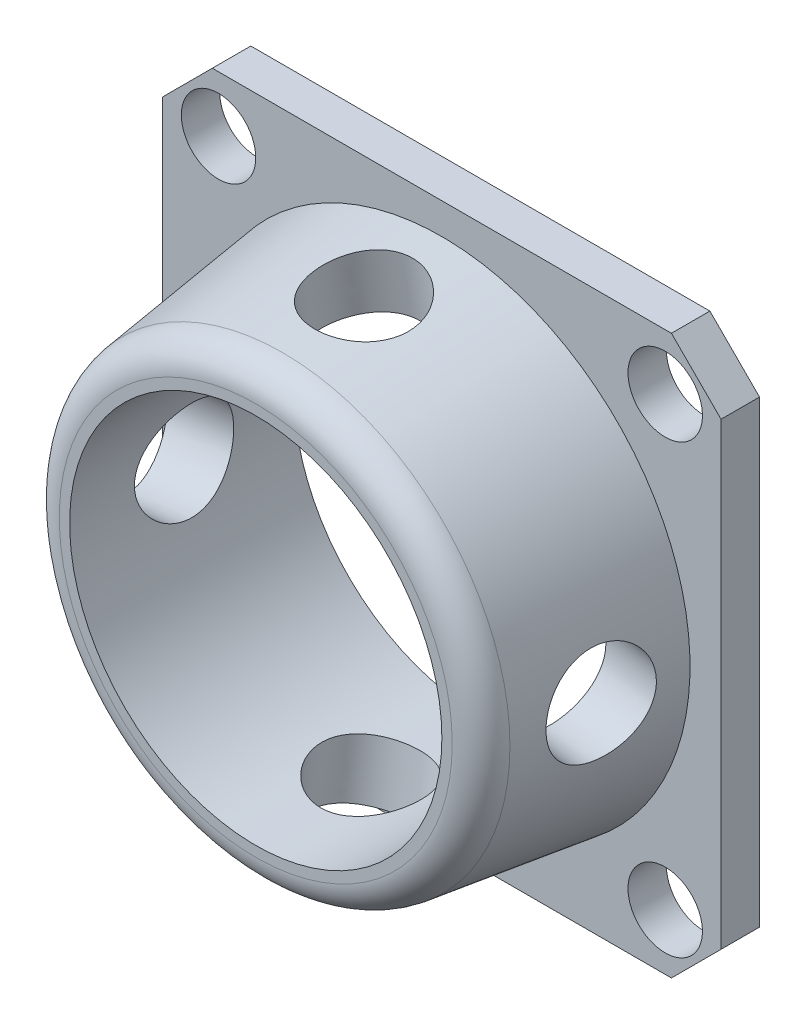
ISO-10303-21;
HEADER;
FILE_DESCRIPTION(('STEP AP214'),'2;1');
FILE_NAME('part.step','',(''),(''),'','','');
FILE_SCHEMA(('AUTOMOTIVE_DESIGN { 1 0 10303 214 1 1 1 1 }'));
ENDSEC;
DATA;
#1=APPLICATION_CONTEXT('core data for automotive mechanical design processes');
#2=APPLICATION_PROTOCOL_DEFINITION('international standard','automotive_design',2000,#1);
#3=PRODUCT_CONTEXT('',#1,'mechanical');
#4=PRODUCT('Part','Part','',(#3));
#5=PRODUCT_RELATED_PRODUCT_CATEGORY('part','',(#4));
#6=PRODUCT_DEFINITION_FORMATION('','',#4);
#7=PRODUCT_DEFINITION_CONTEXT('part definition',#1,'design');
#8=PRODUCT_DEFINITION('design','',#6,#7);
#9=PRODUCT_DEFINITION_SHAPE('','',#8);
#10=(LENGTH_UNIT() NAMED_UNIT(*) SI_UNIT(.MILLI.,.METRE.));
#11=(NAMED_UNIT(*) PLANE_ANGLE_UNIT() SI_UNIT($,.RADIAN.));
#12=(NAMED_UNIT(*) SI_UNIT($,.STERADIAN.) SOLID_ANGLE_UNIT());
#13=UNCERTAINTY_MEASURE_WITH_UNIT(LENGTH_MEASURE(1.E-05),#10,'distance_accuracy_value','');
#14=(GEOMETRIC_REPRESENTATION_CONTEXT(3) GLOBAL_UNCERTAINTY_ASSIGNED_CONTEXT((#13)) GLOBAL_UNIT_ASSIGNED_CONTEXT((#10,
#11,#12)) REPRESENTATION_CONTEXT('',''));
#15=CARTESIAN_POINT('',(0.,0.,0.));
#16=DIRECTION('',(0.,0.,1.));
#17=DIRECTION('',(1.,0.,0.));
#18=AXIS2_PLACEMENT_3D('',#15,#16,#17);
#19=CARTESIAN_POINT('',(0.,0.,0.));
#20=DIRECTION('',(0.,0.,0.999999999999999));
#21=DIRECTION('',(0.999999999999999,0.,0.));
#22=AXIS2_PLACEMENT_3D('',#19,#20,#21);
#23=CYLINDRICAL_SURFACE('',#22,15.);
#24=CARTESIAN_POINT('',(0.,15.,12.8548952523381));
#25=CARTESIAN_POINT('',(0.106332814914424,14.9999996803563,12.8548946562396));
#26=CARTESIAN_POINT('',(0.212679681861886,14.9988664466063,12.8505016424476));
#27=CARTESIAN_POINT('',(0.424643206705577,14.9943631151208,12.8329708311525));
#28=CARTESIAN_POINT('',(0.530259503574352,14.9909919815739,12.819828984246));
#29=CARTESIAN_POINT('',(0.740673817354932,14.9820747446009,12.7848160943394));
#30=CARTESIAN_POINT('',(0.845461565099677,14.9765141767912,12.762886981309));
#31=CARTESIAN_POINT('',(1.05279572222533,14.963369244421,12.7105152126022));
#32=CARTESIAN_POINT('',(1.15534124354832,14.9557840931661,12.6800692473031));
#33=CARTESIAN_POINT('',(1.35757712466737,14.9387846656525,12.6109210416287));
#34=CARTESIAN_POINT('',(1.45726440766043,14.9293684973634,12.5722102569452));
#35=CARTESIAN_POINT('',(1.65305444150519,14.908961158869,12.486907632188));
#36=CARTESIAN_POINT('',(1.74915579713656,14.8979693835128,12.4403127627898));
#37=CARTESIAN_POINT('',(2.03327323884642,14.8627845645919,12.2881477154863));
#38=CARTESIAN_POINT('',(2.21496514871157,14.8365703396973,12.1709323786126));
#39=CARTESIAN_POINT('',(2.55703884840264,14.7814643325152,11.9094730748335));
#40=CARTESIAN_POINT('',(2.7174212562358,14.7525726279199,11.7652298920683));
#41=CARTESIAN_POINT('',(3.02256162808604,14.6931856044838,11.444093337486));
#42=CARTESIAN_POINT('',(3.16581098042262,14.6626977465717,11.26576297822));
#43=CARTESIAN_POINT('',(3.42132481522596,14.6051966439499,10.8874283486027));
#44=CARTESIAN_POINT('',(3.53358074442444,14.5781843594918,10.6874181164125));
#45=CARTESIAN_POINT('',(3.67728480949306,14.5423540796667,10.3729282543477));
#46=CARTESIAN_POINT('',(3.72142905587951,14.5310915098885,10.264360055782));
#47=CARTESIAN_POINT('',(3.80037164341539,14.5106459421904,10.0437019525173));
#48=CARTESIAN_POINT('',(3.83517374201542,14.501462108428,9.9316134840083));
#49=CARTESIAN_POINT('',(3.89508308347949,14.4854854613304,9.70469191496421));
#50=CARTESIAN_POINT('',(3.9201887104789,14.4786930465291,9.58985836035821));
#51=CARTESIAN_POINT('',(3.9603867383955,14.4677494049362,9.35837447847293));
#52=CARTESIAN_POINT('',(3.97548374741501,14.4635969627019,9.24172501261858));
#53=CARTESIAN_POINT('',(3.99505772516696,14.4582022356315,9.01203986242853));
#54=CARTESIAN_POINT('',(3.99992446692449,14.4568531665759,8.89903982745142));
#55=CARTESIAN_POINT('',(4.00007374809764,14.456811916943,8.67307641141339));
#56=CARTESIAN_POINT('',(3.99536032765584,14.4581186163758,8.56011303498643));
#57=CARTESIAN_POINT('',(3.9763131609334,14.4633685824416,8.33506549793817));
#58=CARTESIAN_POINT('',(3.96197979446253,14.4673117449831,8.22298130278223));
#59=CARTESIAN_POINT('',(3.92374559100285,14.4777281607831,8.00057733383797));
#60=CARTESIAN_POINT('',(3.89984502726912,14.48420134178,7.89025750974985));
#61=CARTESIAN_POINT('',(3.84392676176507,14.4991387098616,7.67719895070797));
#62=CARTESIAN_POINT('',(3.81232607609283,14.5074993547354,7.57434324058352));
#63=CARTESIAN_POINT('',(3.74074679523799,14.526120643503,7.37172889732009));
#64=CARTESIAN_POINT('',(3.70076536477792,14.536381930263,7.27197132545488));
#65=CARTESIAN_POINT('',(3.61272621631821,14.558511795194,7.07630854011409));
#66=CARTESIAN_POINT('',(3.56467136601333,14.570379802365,6.98040197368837));
#67=CARTESIAN_POINT('',(3.46083020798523,14.5953934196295,6.79303103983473));
#68=CARTESIAN_POINT('',(3.40504099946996,14.6085395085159,6.70156835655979));
#69=CARTESIAN_POINT('',(3.22642387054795,14.6494064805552,6.43443565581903));
#70=CARTESIAN_POINT('',(3.0924488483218,14.6785291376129,6.26624778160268));
#71=CARTESIAN_POINT('',(2.79880558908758,14.7373359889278,5.95432790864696));
#72=CARTESIAN_POINT('',(2.63913367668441,14.7670202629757,5.81059941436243));
#73=CARTESIAN_POINT('',(2.29324768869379,14.8247292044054,5.54690019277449));
#74=CARTESIAN_POINT('',(2.1063888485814,14.8526789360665,5.42775676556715));
#75=CARTESIAN_POINT('',(1.71503332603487,14.902937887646,5.22157917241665));
#76=CARTESIAN_POINT('',(1.51053535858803,14.9252466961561,5.1345473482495));
#77=CARTESIAN_POINT('',(1.08636565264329,14.962143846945,4.9936407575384));
#78=CARTESIAN_POINT('',(0.866514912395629,14.9766137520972,4.94027274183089));
#79=CARTESIAN_POINT('',(0.420641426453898,14.9957606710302,4.87010795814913));
#80=CARTESIAN_POINT('',(0.194618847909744,15.0004379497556,4.85331020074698));
#81=CARTESIAN_POINT('',(-0.256303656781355,14.999498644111,4.85670973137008));
#82=CARTESIAN_POINT('',(-0.481204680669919,14.9939193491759,4.87677300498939));
#83=CARTESIAN_POINT('',(-0.924315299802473,14.9731377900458,4.95311615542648));
#84=CARTESIAN_POINT('',(-1.14252473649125,14.9579352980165,5.00939688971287));
#85=CARTESIAN_POINT('',(-1.56609567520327,14.9195374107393,5.15675467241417));
#86=CARTESIAN_POINT('',(-1.77145777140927,14.8963423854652,5.24783011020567));
#87=CARTESIAN_POINT('',(-2.16363536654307,14.8444552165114,5.46256174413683));
#88=CARTESIAN_POINT('',(-2.35044956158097,14.81576268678,5.58622022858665));
#89=CARTESIAN_POINT('',(-2.70094614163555,14.7559028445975,5.86367978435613));
#90=CARTESIAN_POINT('',(-2.86453573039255,14.7247263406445,6.01759622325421));
#91=CARTESIAN_POINT('',(-3.16289363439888,14.6635382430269,6.35142059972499));
#92=CARTESIAN_POINT('',(-3.29766492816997,14.6335265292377,6.53132584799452));
#93=CARTESIAN_POINT('',(-3.53246703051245,14.5786164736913,6.90949114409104));
#94=CARTESIAN_POINT('',(-3.63298481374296,14.5536487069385,7.10743833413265));
#95=CARTESIAN_POINT('',(-3.79888512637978,14.5112323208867,7.51827718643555));
#96=CARTESIAN_POINT('',(-3.86427655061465,14.4937817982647,7.73116504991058));
#97=CARTESIAN_POINT('',(-3.9566868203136,14.4688239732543,8.1590243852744));
#98=CARTESIAN_POINT('',(-3.9847848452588,14.4610374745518,8.37374738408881));
#99=CARTESIAN_POINT('',(-4.00578351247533,14.4552350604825,8.80501563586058));
#100=CARTESIAN_POINT('',(-3.99868413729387,14.4572191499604,9.02156088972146));
#101=CARTESIAN_POINT('',(-3.95015604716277,14.470551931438,9.45036181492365));
#102=CARTESIAN_POINT('',(-3.90873735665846,14.4818978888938,9.66261872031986));
#103=CARTESIAN_POINT('',(-3.79338594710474,14.5125377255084,10.0774925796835));
#104=CARTESIAN_POINT('',(-3.71944549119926,14.5318334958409,10.2801072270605));
#105=CARTESIAN_POINT('',(-3.53737335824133,14.5772474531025,10.679685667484));
#106=CARTESIAN_POINT('',(-3.42785652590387,14.60363288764,10.8759880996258));
#107=CARTESIAN_POINT('',(-3.17889469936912,14.6598398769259,11.2480270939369));
#108=CARTESIAN_POINT('',(-3.03944276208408,14.6896622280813,11.4237588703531));
#109=CARTESIAN_POINT('',(-2.72741705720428,14.7508431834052,11.7570461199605));
#110=CARTESIAN_POINT('',(-2.55371533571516,14.7822144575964,11.9135543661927));
#111=CARTESIAN_POINT('',(-2.27483201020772,14.8268022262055,12.1242834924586));
#112=CARTESIAN_POINT('',(-2.17873696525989,14.8412631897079,12.1905615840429));
#113=CARTESIAN_POINT('',(-1.98102045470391,14.8689441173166,12.3145547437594));
#114=CARTESIAN_POINT('',(-1.87940147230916,14.8821646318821,12.3722736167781));
#115=CARTESIAN_POINT('',(-1.67311399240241,14.9067533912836,12.477686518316));
#116=CARTESIAN_POINT('',(-1.56852827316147,14.9181496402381,12.5255362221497));
#117=CARTESIAN_POINT('',(-1.35544997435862,14.9390161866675,12.611949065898));
#118=CARTESIAN_POINT('',(-1.24695920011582,14.9484873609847,12.6505164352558));
#119=CARTESIAN_POINT('',(-1.02704560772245,14.9652035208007,12.7179114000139));
#120=CARTESIAN_POINT('',(-0.915628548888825,14.9724525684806,12.7467567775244));
#121=CARTESIAN_POINT('',(-0.690598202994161,14.9845171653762,12.7944622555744));
#122=CARTESIAN_POINT('',(-0.576986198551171,14.9893340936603,12.8133280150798));
#123=CARTESIAN_POINT('',(-0.385980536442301,14.9952301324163,12.8363516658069));
#124=CARTESIAN_POINT('',(-0.308933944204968,14.9970170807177,12.843304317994));
#125=CARTESIAN_POINT('',(-0.154593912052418,14.9994017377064,12.852574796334));
#126=CARTESIAN_POINT('',(-0.0773006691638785,15.0000002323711,12.8548956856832));
#127=CARTESIAN_POINT('',(0.,15.,12.8548952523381));
#128=B_SPLINE_CURVE_WITH_KNOTS('',3,(#24,#25,#26,#27,#28,#29,#30,#31,#32,#33,#34,#35,#36,#37,
#38,#39,#40,#41,#42,#43,#44,#45,#46,#47,#48,#49,#50,#51,#52,#53,#54,#55,#56,#57,#58,#59,#60,#61,
#62,#63,#64,#65,#66,#67,#68,#69,#70,#71,#72,#73,#74,#75,#76,#77,#78,#79,#80,#81,#82,#83,#84,#85,
#86,#87,#88,#89,#90,#91,#92,#93,#94,#95,#96,#97,#98,#99,#100,#101,#102,#103,#104,#105,#106,#107,
#108,#109,#110,#111,#112,#113,#114,#115,#116,#117,#118,#119,#120,#121,#122,#123,#124,#125,#126,
#127),.UNSPECIFIED.,.T.,.F.,(4,2,2,2,2,2,2,2,2,2,2,2,2,2,2,2,2,2,2,2,2,2,2,2,2,2,2,2,2,2,2,2,2,
2,2,2,2,2,2,2,2,2,2,2,2,2,2,2,2,2,2,4),(0.,0.318926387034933,0.638000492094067,
0.959218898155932,1.28056230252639,1.6022395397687,1.92404065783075,2.57436716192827,
3.22467480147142,3.91388458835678,4.60328438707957,4.95613688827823,5.30884725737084,
5.66161637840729,6.01422296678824,6.35313188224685,6.69189790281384,7.03065054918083,
7.36939352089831,7.69278275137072,8.01628156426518,8.33966571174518,8.66317147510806,
9.31092464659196,9.95877054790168,10.6257553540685,11.2927887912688,11.969637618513,
12.6464681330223,13.3208427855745,13.9952334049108,14.6695928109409,15.3439995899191,
16.0210294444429,16.697989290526,17.364878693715,18.0315991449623,18.6785722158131,
19.3255456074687,19.9723300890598,20.619268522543,21.2952318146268,21.9713520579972,
22.6753298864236,23.0278469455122,23.3802068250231,23.7264919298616,24.0726189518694,
24.4181094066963,24.7634037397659,24.9954068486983,25.2272564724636),.UNSPECIFIED.);
#129=CARTESIAN_POINT('',(0.,15.,12.8548952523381));
#130=VERTEX_POINT('',#129);
#131=EDGE_CURVE('E218',#130,#130,#128,.T.);
#132=ORIENTED_EDGE('',*,*,#131,.T.);
#133=EDGE_LOOP('',(#132));
#134=FACE_BOUND('',#133,.T.);
#135=CARTESIAN_POINT('',(0.,-15.,12.8548952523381));
#136=CARTESIAN_POINT('',(-0.106332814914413,-14.9999996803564,12.8548946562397));
#137=CARTESIAN_POINT('',(-0.212679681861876,-14.9988664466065,12.8505016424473));
#138=CARTESIAN_POINT('',(-0.424643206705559,-14.9943631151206,12.8329708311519));
#139=CARTESIAN_POINT('',(-0.530259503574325,-14.9909919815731,12.8198289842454));
#140=CARTESIAN_POINT('',(-0.740673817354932,-14.9820747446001,12.7848160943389));
#141=CARTESIAN_POINT('',(-0.845461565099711,-14.976514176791,12.7628869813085));
#142=CARTESIAN_POINT('',(-1.05279572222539,-14.9633692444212,12.7105152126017));
#143=CARTESIAN_POINT('',(-1.15534124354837,-14.9557840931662,12.6800692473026));
#144=CARTESIAN_POINT('',(-1.35757712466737,-14.9387846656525,12.6109210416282));
#145=CARTESIAN_POINT('',(-1.45726440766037,-14.9293684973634,12.5722102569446));
#146=CARTESIAN_POINT('',(-1.65305444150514,-14.908961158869,12.4869076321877));
#147=CARTESIAN_POINT('',(-1.74915579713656,-14.8979693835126,12.4403127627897));
#148=CARTESIAN_POINT('',(-2.03327323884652,-14.8627845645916,12.2881477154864));
#149=CARTESIAN_POINT('',(-2.21496514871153,-14.8365703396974,12.1709323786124));
#150=CARTESIAN_POINT('',(-2.55703884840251,-14.7814643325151,11.9094730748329));
#151=CARTESIAN_POINT('',(-2.71742125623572,-14.7525726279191,11.7652298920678));
#152=CARTESIAN_POINT('',(-3.02256162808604,-14.693185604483,11.4440933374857));
#153=CARTESIAN_POINT('',(-3.16581098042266,-14.6626977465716,11.2657629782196));
#154=CARTESIAN_POINT('',(-3.42132481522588,-14.60519664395,10.8874283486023));
#155=CARTESIAN_POINT('',(-3.53358074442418,-14.5781843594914,10.6874181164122));
#156=CARTESIAN_POINT('',(-3.67728480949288,-14.5423540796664,10.3729282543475));
#157=CARTESIAN_POINT('',(-3.72142905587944,-14.5310915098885,10.2643600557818));
#158=CARTESIAN_POINT('',(-3.8003716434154,-14.5106459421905,10.043701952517));
#159=CARTESIAN_POINT('',(-3.83517374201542,-14.501462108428,9.93161348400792));
#160=CARTESIAN_POINT('',(-3.8950830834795,-14.4854854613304,9.70469191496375));
#161=CARTESIAN_POINT('',(-3.92018871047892,-14.4786930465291,9.58985836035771));
#162=CARTESIAN_POINT('',(-3.96038673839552,-14.4677494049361,9.35837447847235));
#163=CARTESIAN_POINT('',(-3.97548374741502,-14.4635969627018,9.24172501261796));
#164=CARTESIAN_POINT('',(-3.99505772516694,-14.4582022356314,9.01203986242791));
#165=CARTESIAN_POINT('',(-3.99992446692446,-14.4568531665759,8.89903982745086));
#166=CARTESIAN_POINT('',(-4.0000737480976,-14.456811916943,8.67307641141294));
#167=CARTESIAN_POINT('',(-3.9953603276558,-14.4581186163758,8.56011303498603));
#168=CARTESIAN_POINT('',(-3.97631316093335,-14.4633685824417,8.3350654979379));
#169=CARTESIAN_POINT('',(-3.96197979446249,-14.4673117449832,8.22298130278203));
#170=CARTESIAN_POINT('',(-3.92374559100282,-14.4777281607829,8.00057733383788));
#171=CARTESIAN_POINT('',(-3.8998450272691,-14.4842013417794,7.89025750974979));
#172=CARTESIAN_POINT('',(-3.84392676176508,-14.499138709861,7.67719895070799));
#173=CARTESIAN_POINT('',(-3.81232607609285,-14.5074993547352,7.57434324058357));
#174=CARTESIAN_POINT('',(-3.74074679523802,-14.5261206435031,7.37172889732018));
#175=CARTESIAN_POINT('',(-3.70076536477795,-14.5363819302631,7.27197132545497));
#176=CARTESIAN_POINT('',(-3.61272621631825,-14.5585117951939,7.07630854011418));
#177=CARTESIAN_POINT('',(-3.56467136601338,-14.570379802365,6.98040197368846));
#178=CARTESIAN_POINT('',(-3.46083020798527,-14.5953934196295,6.79303103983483));
#179=CARTESIAN_POINT('',(-3.40504099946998,-14.6085395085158,6.70156835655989));
#180=CARTESIAN_POINT('',(-3.22642387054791,-14.6494064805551,6.43443565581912));
#181=CARTESIAN_POINT('',(-3.09244884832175,-14.6785291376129,6.26624778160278));
#182=CARTESIAN_POINT('',(-2.79880558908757,-14.7373359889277,5.9543279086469));
#183=CARTESIAN_POINT('',(-2.63913367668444,-14.7670202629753,5.8105994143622));
#184=CARTESIAN_POINT('',(-2.2932476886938,-14.8247292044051,5.54690019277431));
#185=CARTESIAN_POINT('',(-2.10638884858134,-14.8526789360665,5.42775676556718));
#186=CARTESIAN_POINT('',(-1.71503332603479,-14.902937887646,5.22157917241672));
#187=CARTESIAN_POINT('',(-1.51053535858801,-14.9252466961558,5.13454734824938));
#188=CARTESIAN_POINT('',(-1.08636565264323,-14.9621438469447,4.99364075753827));
#189=CARTESIAN_POINT('',(-0.866514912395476,-14.9766137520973,4.94027274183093));
#190=CARTESIAN_POINT('',(-0.420641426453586,-14.9957606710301,4.8701079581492));
#191=CARTESIAN_POINT('',(-0.194618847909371,-15.000437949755,4.85331020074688));
#192=CARTESIAN_POINT('',(0.256303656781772,-14.9994986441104,4.85670973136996));
#193=CARTESIAN_POINT('',(0.481204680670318,-14.9939193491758,4.8767730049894));
#194=CARTESIAN_POINT('',(0.924315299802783,-14.9731377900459,4.95311615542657));
#195=CARTESIAN_POINT('',(1.14252473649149,-14.957935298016,5.00939688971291));
#196=CARTESIAN_POINT('',(1.56609567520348,-14.9195374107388,5.15675467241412));
#197=CARTESIAN_POINT('',(1.77145777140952,-14.8963423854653,5.24783011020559));
#198=CARTESIAN_POINT('',(2.16363536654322,-14.8444552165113,5.46256174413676));
#199=CARTESIAN_POINT('',(2.35044956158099,-14.8157626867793,5.58622022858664));
#200=CARTESIAN_POINT('',(2.70094614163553,-14.7559028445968,5.86367978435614));
#201=CARTESIAN_POINT('',(2.86453573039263,-14.7247263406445,6.01759622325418));
#202=CARTESIAN_POINT('',(3.16289363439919,-14.6635382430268,6.35142059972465));
#203=CARTESIAN_POINT('',(3.29766492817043,-14.633526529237,6.53132584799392));
#204=CARTESIAN_POINT('',(3.5324670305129,-14.5786164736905,6.90949114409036));
#205=CARTESIAN_POINT('',(3.63298481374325,-14.5536487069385,7.10743833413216));
#206=CARTESIAN_POINT('',(3.79888512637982,-14.5112323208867,7.51827718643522));
#207=CARTESIAN_POINT('',(3.86427655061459,-14.493781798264,7.73116504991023));
#208=CARTESIAN_POINT('',(3.95668682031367,-14.4688239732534,8.15902438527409));
#209=CARTESIAN_POINT('',(3.98478484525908,-14.4610374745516,8.37374738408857));
#210=CARTESIAN_POINT('',(4.00578351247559,-14.4552350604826,8.80501563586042));
#211=CARTESIAN_POINT('',(3.99868413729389,-14.4572191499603,9.02156088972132));
#212=CARTESIAN_POINT('',(3.95015604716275,-14.4705519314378,9.45036181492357));
#213=CARTESIAN_POINT('',(3.90873735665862,-14.4818978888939,9.66261872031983));
#214=CARTESIAN_POINT('',(3.79338594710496,-14.5125377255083,10.0774925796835));
#215=CARTESIAN_POINT('',(3.71944549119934,-14.5318334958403,10.2801072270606));
#216=CARTESIAN_POINT('',(3.53737335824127,-14.5772474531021,10.679685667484));
#217=CARTESIAN_POINT('',(3.42785652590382,-14.6036328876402,10.8759880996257));
#218=CARTESIAN_POINT('',(3.17889469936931,-14.6598398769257,11.248027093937));
#219=CARTESIAN_POINT('',(3.03944276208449,-14.6896622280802,11.4237588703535));
#220=CARTESIAN_POINT('',(2.72741705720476,-14.7508431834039,11.7570461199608));
#221=CARTESIAN_POINT('',(2.55371533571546,-14.7822144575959,11.9135543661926));
#222=CARTESIAN_POINT('',(2.27483201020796,-14.8268022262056,12.1242834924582));
#223=CARTESIAN_POINT('',(2.17873696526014,-14.8412631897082,12.1905615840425));
#224=CARTESIAN_POINT('',(1.98102045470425,-14.8689441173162,12.3145547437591));
#225=CARTESIAN_POINT('',(1.87940147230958,-14.882164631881,12.3722736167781));
#226=CARTESIAN_POINT('',(1.67311399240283,-14.9067533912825,12.4776865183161));
#227=CARTESIAN_POINT('',(1.5685282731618,-14.9181496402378,12.5255362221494));
#228=CARTESIAN_POINT('',(1.35544997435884,-14.9390161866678,12.6119490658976));
#229=CARTESIAN_POINT('',(1.24695920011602,-14.9484873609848,12.6505164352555));
#230=CARTESIAN_POINT('',(1.02704560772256,-14.9652035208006,12.7179114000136));
#231=CARTESIAN_POINT('',(0.915628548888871,-14.9724525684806,12.7467567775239));
#232=CARTESIAN_POINT('',(0.690598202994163,-14.9845171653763,12.7944622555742));
#233=CARTESIAN_POINT('',(0.576986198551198,-14.9893340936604,12.81332801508));
#234=CARTESIAN_POINT('',(0.3859805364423,-14.9952301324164,12.8363516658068));
#235=CARTESIAN_POINT('',(0.308933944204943,-14.9970170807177,12.8433043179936));
#236=CARTESIAN_POINT('',(0.154593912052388,-14.9994017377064,12.8525747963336));
#237=CARTESIAN_POINT('',(0.0773006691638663,-15.0000002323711,12.8548956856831));
#238=CARTESIAN_POINT('',(0.,-15.,12.8548952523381));
#239=B_SPLINE_CURVE_WITH_KNOTS('',3,(#135,#136,#137,#138,#139,#140,#141,#142,#143,#144,#145,
#146,#147,#148,#149,#150,#151,#152,#153,#154,#155,#156,#157,#158,#159,#160,#161,#162,#163,#164,
#165,#166,#167,#168,#169,#170,#171,#172,#173,#174,#175,#176,#177,#178,#179,#180,#181,#182,#183,
#184,#185,#186,#187,#188,#189,#190,#191,#192,#193,#194,#195,#196,#197,#198,#199,#200,#201,#202,
#203,#204,#205,#206,#207,#208,#209,#210,#211,#212,#213,#214,#215,#216,#217,#218,#219,#220,#221,
#222,#223,#224,#225,#226,#227,#228,#229,#230,#231,#232,#233,#234,#235,#236,#237,#238),
.UNSPECIFIED.,.T.,.F.,(4,2,2,2,2,2,2,2,2,2,2,2,2,2,2,2,2,2,2,2,2,2,2,2,2,2,2,2,2,2,2,2,2,2,2,2,
2,2,2,2,2,2,2,2,2,2,2,2,2,2,2,4),(0.,0.318926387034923,0.638000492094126,0.959218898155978,
1.28056230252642,1.60223953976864,1.92404065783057,2.57436716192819,3.22467480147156,
3.91388458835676,4.60328438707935,4.95613688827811,5.30884725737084,5.66161637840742,
6.0142229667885,6.35313188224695,6.69189790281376,7.03065054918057,7.36939352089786,
7.69278275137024,8.01628156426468,8.33966571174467,8.66317147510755,9.31092464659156,
9.95877054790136,10.6257553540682,11.2927887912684,11.9696376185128,12.6464681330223,
13.3208427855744,13.9952334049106,14.6695928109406,15.3439995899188,16.0210294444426,
16.6979892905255,17.3648786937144,18.0315991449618,18.6785722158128,19.3255456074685,
19.9723300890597,20.6192685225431,21.2952318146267,21.971352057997,22.6753298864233,
23.0278469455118,23.3802068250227,23.7264919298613,24.0726189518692,24.4181094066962,
24.7634037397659,24.9954068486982,25.2272564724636),.UNSPECIFIED.);
#240=CARTESIAN_POINT('',(0.,-15.,12.8548952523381));
#241=VERTEX_POINT('',#240);
#242=EDGE_CURVE('E217',#241,#241,#239,.T.);
#243=ORIENTED_EDGE('',*,*,#242,.T.);
#244=EDGE_LOOP('',(#243));
#245=FACE_BOUND('',#244,.T.);
#246=CARTESIAN_POINT('',(0.,0.,0.));
#247=DIRECTION('',(0.,0.,1.));
#248=DIRECTION('',(0.999999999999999,0.,0.));
#249=AXIS2_PLACEMENT_3D('',#246,#247,#248);
#250=CIRCLE('',#249,15.);
#251=CARTESIAN_POINT('',(15.,0.,0.));
#252=VERTEX_POINT('',#251);
#253=EDGE_CURVE('E345',#252,#252,#250,.T.);
#254=ORIENTED_EDGE('',*,*,#253,.F.);
#255=EDGE_LOOP('',(#254));
#256=FACE_BOUND('',#255,.T.);
#257=CARTESIAN_POINT('',(0.,0.,18.1));
#258=DIRECTION('',(0.,0.,1.));
#259=DIRECTION('',(0.999999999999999,0.,0.));
#260=AXIS2_PLACEMENT_3D('',#257,#258,#259);
#261=CIRCLE('',#260,15.);
#262=CARTESIAN_POINT('',(15.,0.,18.1));
#263=VERTEX_POINT('',#262);
#264=EDGE_CURVE('E254',#263,#263,#261,.T.);
#265=ORIENTED_EDGE('',*,*,#264,.T.);
#266=EDGE_LOOP('',(#265));
#267=FACE_BOUND('',#266,.T.);
#268=CARTESIAN_POINT('',(14.9999999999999,1.11022302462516E-13,4.87849079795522));
#269=CARTESIAN_POINT('',(14.9999963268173,-0.225320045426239,4.87849568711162));
#270=CARTESIAN_POINT('',(14.9948744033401,-0.450701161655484,4.89690795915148));
#271=CARTESIAN_POINT('',(14.9749237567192,-0.895106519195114,4.970109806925));
#272=CARTESIAN_POINT('',(14.9600904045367,-1.11412767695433,5.02491673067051));
#273=CARTESIAN_POINT('',(14.9223195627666,-1.53946885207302,5.16950325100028));
#274=CARTESIAN_POINT('',(14.8993852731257,-1.74579384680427,5.25926903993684));
#275=CARTESIAN_POINT('',(14.8478865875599,-2.14005443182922,5.47157367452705));
#276=CARTESIAN_POINT('',(14.8193223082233,-2.32799040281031,5.59411184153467));
#277=CARTESIAN_POINT('',(14.7596157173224,-2.68064471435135,5.86936130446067));
#278=CARTESIAN_POINT('',(14.7284669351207,-2.84530180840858,6.02214974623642));
#279=CARTESIAN_POINT('',(14.6671887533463,-3.14597740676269,6.35389374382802));
#280=CARTESIAN_POINT('',(14.6370592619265,-3.28199849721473,6.53284693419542));
#281=CARTESIAN_POINT('',(14.5817658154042,-3.51949122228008,6.90943296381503));
#282=CARTESIAN_POINT('',(14.5565367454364,-3.62143110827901,7.10676052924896));
#283=CARTESIAN_POINT('',(14.5135016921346,-3.79023976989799,7.51662095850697));
#284=CARTESIAN_POINT('',(14.4956938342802,-3.85711740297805,7.72914996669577));
#285=CARTESIAN_POINT('',(14.4699849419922,-3.95245711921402,8.15655573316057));
#286=CARTESIAN_POINT('',(14.4618053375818,-3.98200132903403,8.37117521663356));
#287=CARTESIAN_POINT('',(14.4552182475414,-4.00584863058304,8.80248838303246));
#288=CARTESIAN_POINT('',(14.4568106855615,-4.00015199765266,9.01918204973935));
#289=CARTESIAN_POINT('',(14.4694002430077,-3.95436378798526,9.44830027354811));
#290=CARTESIAN_POINT('',(14.480385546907,-3.91431542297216,9.66072985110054));
#291=CARTESIAN_POINT('',(14.5103689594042,-3.80165199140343,10.076163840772));
#292=CARTESIAN_POINT('',(14.5293688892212,-3.7290295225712,10.2791660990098));
#293=CARTESIAN_POINT('',(14.5742572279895,-3.54963515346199,10.6796139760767));
#294=CARTESIAN_POINT('',(14.6004131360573,-3.44149494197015,10.8764167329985));
#295=CARTESIAN_POINT('',(14.6562789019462,-3.19521892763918,11.2496998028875));
#296=CARTESIAN_POINT('',(14.6859898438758,-3.05707396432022,11.4261738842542));
#297=CARTESIAN_POINT('',(14.7471055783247,-2.74748683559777,11.7613665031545));
#298=CARTESIAN_POINT('',(14.7785289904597,-2.57488686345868,11.9190234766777));
#299=CARTESIAN_POINT('',(14.8232939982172,-2.29755939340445,12.1315934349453));
#300=CARTESIAN_POINT('',(14.8378279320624,-2.20198845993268,12.1984941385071));
#301=CARTESIAN_POINT('',(14.865689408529,-2.00527402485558,12.3237873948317));
#302=CARTESIAN_POINT('',(14.8790174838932,-1.90413301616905,12.3821837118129));
#303=CARTESIAN_POINT('',(14.9038593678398,-1.69867829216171,12.4890244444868));
#304=CARTESIAN_POINT('',(14.9153996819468,-1.59444540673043,12.5376183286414));
#305=CARTESIAN_POINT('',(14.9365806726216,-1.38200699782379,12.625556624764));
#306=CARTESIAN_POINT('',(14.9462221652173,-1.27380320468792,12.66490501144));
#307=CARTESIAN_POINT('',(14.9633141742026,-1.05420795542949,12.7339478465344));
#308=CARTESIAN_POINT('',(14.9707650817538,-0.942817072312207,12.7636440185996));
#309=CARTESIAN_POINT('',(14.9832438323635,-0.717709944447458,12.8130510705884));
#310=CARTESIAN_POINT('',(14.9882718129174,-0.603993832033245,12.8327625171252));
#311=CARTESIAN_POINT('',(14.9955201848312,-0.382040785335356,12.8610891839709));
#312=CARTESIAN_POINT('',(14.9978908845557,-0.273884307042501,12.8702990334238));
#313=CARTESIAN_POINT('',(15.0002830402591,-0.0571159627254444,12.879591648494));
#314=CARTESIAN_POINT('',(15.000303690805,0.0514960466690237,12.8796712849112));
#315=CARTESIAN_POINT('',(14.9979921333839,0.2682658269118,12.8706929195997));
#316=CARTESIAN_POINT('',(14.9956611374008,0.376423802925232,12.8616396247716));
#317=CARTESIAN_POINT('',(14.9887188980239,0.591539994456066,12.8345100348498));
#318=CARTESIAN_POINT('',(14.9841068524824,0.698497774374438,12.8164305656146));
#319=CARTESIAN_POINT('',(14.9673462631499,1.01038957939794,12.750170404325));
#320=CARTESIAN_POINT('',(14.9521912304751,1.21267719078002,12.689678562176));
#321=CARTESIAN_POINT('',(14.9152473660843,1.60443333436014,12.5374332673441));
#322=CARTESIAN_POINT('',(14.8934575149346,1.7938998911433,12.4456750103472));
#323=CARTESIAN_POINT('',(14.8570116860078,2.06837908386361,12.2850782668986));
#324=CARTESIAN_POINT('',(14.8439732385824,2.1597560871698,12.2264805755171));
#325=CARTESIAN_POINT('',(14.8170371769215,2.33740536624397,12.1021807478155));
#326=CARTESIAN_POINT('',(14.803139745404,2.42367872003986,12.0364801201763));
#327=CARTESIAN_POINT('',(14.7748351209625,2.59064105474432,11.8984468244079));
#328=CARTESIAN_POINT('',(14.7604279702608,2.67133049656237,11.8261147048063));
#329=CARTESIAN_POINT('',(14.7314506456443,2.82676878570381,11.675245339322));
#330=CARTESIAN_POINT('',(14.7168803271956,2.90151179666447,11.5967021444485));
#331=CARTESIAN_POINT('',(14.671813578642,3.1243718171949,11.3431520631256));
#332=CARTESIAN_POINT('',(14.6416591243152,3.2614606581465,11.1581657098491));
#333=CARTESIAN_POINT('',(14.585673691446,3.50337610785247,10.7675704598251));
#334=CARTESIAN_POINT('',(14.559842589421,3.60820363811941,10.561962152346));
#335=CARTESIAN_POINT('',(14.5264556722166,3.73953626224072,10.2406679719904));
#336=CARTESIAN_POINT('',(14.5161599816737,3.77920524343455,10.1304915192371));
#337=CARTESIAN_POINT('',(14.4978017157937,3.84903351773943,9.90706432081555));
#338=CARTESIAN_POINT('',(14.4897370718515,3.87920162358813,9.79381653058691));
#339=CARTESIAN_POINT('',(14.4761149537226,3.92973021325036,9.5649995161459));
#340=CARTESIAN_POINT('',(14.4705576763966,3.95008992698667,9.44943011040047));
#341=CARTESIAN_POINT('',(14.4621585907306,3.98073155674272,9.21683641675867));
#342=CARTESIAN_POINT('',(14.4593172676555,3.99101167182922,9.09981187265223));
#343=CARTESIAN_POINT('',(14.4565385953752,4.00106439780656,8.87045447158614));
#344=CARTESIAN_POINT('',(14.4564786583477,4.00128057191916,8.75814240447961));
#345=CARTESIAN_POINT('',(14.4589802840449,3.99223143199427,8.53392959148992));
#346=CARTESIAN_POINT('',(14.4615417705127,3.98296639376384,8.42202883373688));
#347=CARTESIAN_POINT('',(14.4692262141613,3.95495926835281,8.19953189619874));
#348=CARTESIAN_POINT('',(14.4743486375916,3.9362191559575,8.08893544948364));
#349=CARTESIAN_POINT('',(14.4870102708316,3.88936006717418,7.86988843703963));
#350=CARTESIAN_POINT('',(14.4945494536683,3.8612411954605,7.76143784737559));
#351=CARTESIAN_POINT('',(14.5114636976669,3.79716616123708,7.55193165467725));
#352=CARTESIAN_POINT('',(14.5207503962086,3.76158032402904,7.45075542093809));
#353=CARTESIAN_POINT('',(14.5410825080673,3.68220018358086,7.2518214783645));
#354=CARTESIAN_POINT('',(14.5521285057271,3.63840315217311,7.15406491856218));
#355=CARTESIAN_POINT('',(14.5756658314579,3.54293356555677,6.96269460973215));
#356=CARTESIAN_POINT('',(14.5881566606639,3.49126372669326,6.86907944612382));
#357=CARTESIAN_POINT('',(14.6142408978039,3.38041560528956,6.68655313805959));
#358=CARTESIAN_POINT('',(14.6278347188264,3.3212345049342,6.5976437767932));
#359=CARTESIAN_POINT('',(14.6699239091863,3.13210255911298,6.33757635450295));
#360=CARTESIAN_POINT('',(14.6995608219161,2.99120797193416,6.17436866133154));
#361=CARTESIAN_POINT('',(14.758643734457,2.68454610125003,5.87339313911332));
#362=CARTESIAN_POINT('',(14.7880896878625,2.51877299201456,5.73563128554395));
#363=CARTESIAN_POINT('',(14.8445846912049,2.16146570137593,5.48489375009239));
#364=CARTESIAN_POINT('',(14.8715364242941,1.96931204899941,5.37277696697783));
#365=CARTESIAN_POINT('',(14.9191177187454,1.568614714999,5.18147304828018));
#366=CARTESIAN_POINT('',(14.939749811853,1.36007763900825,5.10227272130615));
#367=CARTESIAN_POINT('',(14.9703711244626,0.960579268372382,4.98680597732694));
#368=CARTESIAN_POINT('',(14.9814044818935,0.770922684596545,4.94625747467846));
#369=CARTESIAN_POINT('',(14.9962204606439,0.387525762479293,4.89209792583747));
#370=CARTESIAN_POINT('',(15.0000031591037,0.193785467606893,4.87848659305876));
#371=CARTESIAN_POINT('',(14.9999999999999,1.11022302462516E-13,4.87849079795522));
#372=B_SPLINE_CURVE_WITH_KNOTS('',3,(#268,#269,#270,#271,#272,#273,#274,#275,#276,#277,#278,
#279,#280,#281,#282,#283,#284,#285,#286,#287,#288,#289,#290,#291,#292,#293,#294,#295,#296,#297,
#298,#299,#300,#301,#302,#303,#304,#305,#306,#307,#308,#309,#310,#311,#312,#313,#314,#315,#316,
#317,#318,#319,#320,#321,#322,#323,#324,#325,#326,#327,#328,#329,#330,#331,#332,#333,#334,#335,
#336,#337,#338,#339,#340,#341,#342,#343,#344,#345,#346,#347,#348,#349,#350,#351,#352,#353,#354,
#355,#356,#357,#358,#359,#360,#361,#362,#363,#364,#365,#366,#367,#368,#369,#370,#371),
.UNSPECIFIED.,.T.,.F.,(4,2,2,2,2,2,2,2,2,2,2,2,2,2,2,2,2,2,2,2,2,2,2,2,2,2,2,2,2,2,2,2,2,2,2,2,
2,2,2,2,2,2,2,2,2,2,2,2,2,2,2,4),(0.,0.675264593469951,1.35085129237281,2.02617142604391,
2.70147757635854,3.37852864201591,4.05551853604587,4.72278309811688,5.38987901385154,
6.03715875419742,6.6844334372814,7.33089509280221,7.97750372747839,8.65271075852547,
9.32812422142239,10.0319989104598,10.3843209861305,10.7364866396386,11.0827905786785,
11.4289453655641,11.7750383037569,12.1211115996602,12.4464277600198,12.7718554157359,
13.0971154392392,13.4224899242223,14.0544600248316,14.6865272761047,15.0142230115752,
15.3418492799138,15.669448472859,15.9973653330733,16.6906203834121,17.3838556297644,
17.7361370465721,18.088090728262,18.4400720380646,18.7921162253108,19.1286288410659,
19.465131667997,19.8015643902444,20.137993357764,20.4605714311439,20.7832568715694,
21.1058312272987,21.4285269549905,22.0782198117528,22.7280650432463,23.3972349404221,
24.0661364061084,24.6469007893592,25.2276589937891),.UNSPECIFIED.);
#373=CARTESIAN_POINT('',(14.9999999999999,1.11022302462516E-13,4.87849079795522));
#374=VERTEX_POINT('',#373);
#375=EDGE_CURVE('E270',#374,#374,#372,.T.);
#376=ORIENTED_EDGE('',*,*,#375,.F.);
#377=EDGE_LOOP('',(#376));
#378=FACE_BOUND('',#377,.T.);
#379=CARTESIAN_POINT('',(-15.0000000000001,1.11022302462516E-13,4.87849079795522));
#380=CARTESIAN_POINT('',(-14.9999996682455,0.111051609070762,4.87849123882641));
#381=CARTESIAN_POINT('',(-14.9987637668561,0.222116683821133,4.88295624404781));
#382=CARTESIAN_POINT('',(-14.9938508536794,0.443517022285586,4.90079290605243));
#383=CARTESIAN_POINT('',(-14.9901727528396,0.553851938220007,4.91416853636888));
#384=CARTESIAN_POINT('',(-14.9804077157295,0.774420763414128,4.94997966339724));
#385=CARTESIAN_POINT('',(-14.9742899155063,0.884634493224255,4.97253132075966));
#386=CARTESIAN_POINT('',(-14.9598098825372,1.10274299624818,5.02655950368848));
#387=CARTESIAN_POINT('',(-14.9514467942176,1.21063686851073,5.05803943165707));
#388=CARTESIAN_POINT('',(-14.9326920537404,1.42341804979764,5.12976562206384));
#389=CARTESIAN_POINT('',(-14.9222983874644,1.52830225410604,5.17002059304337));
#390=CARTESIAN_POINT('',(-14.8997728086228,1.73422277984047,5.25902184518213));
#391=CARTESIAN_POINT('',(-14.8876402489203,1.83525765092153,5.30777128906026));
#392=CARTESIAN_POINT('',(-14.8491000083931,2.13161055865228,5.46641576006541));
#393=CARTESIAN_POINT('',(-14.8205469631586,2.32020713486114,5.58871712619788));
#394=CARTESIAN_POINT('',(-14.760904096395,2.67356429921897,5.86318171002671));
#395=CARTESIAN_POINT('',(-14.7298149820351,2.83833149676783,6.01533661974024));
#396=CARTESIAN_POINT('',(-14.6686650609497,3.13907355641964,6.34544017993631));
#397=CARTESIAN_POINT('',(-14.6386020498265,3.27511388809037,6.52332858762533));
#398=CARTESIAN_POINT('',(-14.5829493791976,3.51465282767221,6.90043930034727));
#399=CARTESIAN_POINT('',(-14.5573589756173,3.61815685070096,7.09965804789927));
#400=CARTESIAN_POINT('',(-14.514294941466,3.78717510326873,7.50837481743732));
#401=CARTESIAN_POINT('',(-14.496629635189,3.8535971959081,7.71747714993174));
#402=CARTESIAN_POINT('',(-14.4705003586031,3.95059269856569,8.14437129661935));
#403=CARTESIAN_POINT('',(-14.4620348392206,3.9811721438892,8.36216164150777));
#404=CARTESIAN_POINT('',(-14.4552422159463,4.00576021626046,8.79518629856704));
#405=CARTESIAN_POINT('',(-14.456701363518,4.00053984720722,9.01037511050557));
#406=CARTESIAN_POINT('',(-14.4689273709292,3.95609275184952,9.43702680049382));
#407=CARTESIAN_POINT('',(-14.4796954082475,3.91686172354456,9.64848920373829));
#408=CARTESIAN_POINT('',(-14.5019659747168,3.83324734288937,9.96098801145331));
#409=CARTESIAN_POINT('',(-14.5105473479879,3.80071470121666,10.0655676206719));
#410=CARTESIAN_POINT('',(-14.5295258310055,3.72750884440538,10.2716680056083));
#411=CARTESIAN_POINT('',(-14.5399225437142,3.68683740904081,10.3731894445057));
#412=CARTESIAN_POINT('',(-14.5622414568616,3.59767015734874,10.5725445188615));
#413=CARTESIAN_POINT('',(-14.5741634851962,3.54917522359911,10.6703785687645));
#414=CARTESIAN_POINT('',(-14.5992185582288,3.44466350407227,10.8618750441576));
#415=CARTESIAN_POINT('',(-14.6123527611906,3.3886395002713,10.9555333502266));
#416=CARTESIAN_POINT('',(-14.6544452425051,3.20371139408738,11.2386703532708));
#417=CARTESIAN_POINT('',(-14.6849006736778,3.06249353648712,11.4200820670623));
#418=CARTESIAN_POINT('',(-14.7462598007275,2.75186740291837,11.7568449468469));
#419=CARTESIAN_POINT('',(-14.7771634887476,2.58245962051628,11.9121965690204));
#420=CARTESIAN_POINT('',(-14.8215396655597,2.30884114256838,12.1234219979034));
#421=CARTESIAN_POINT('',(-14.8361238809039,2.21343382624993,12.1907006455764));
#422=CARTESIAN_POINT('',(-14.8640930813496,2.01706406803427,12.3167244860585));
#423=CARTESIAN_POINT('',(-14.8774791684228,1.91610687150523,12.3754775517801));
#424=CARTESIAN_POINT('',(-14.9026611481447,1.70925417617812,12.4839513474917));
#425=CARTESIAN_POINT('',(-14.9144569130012,1.60335828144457,12.5336713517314));
#426=CARTESIAN_POINT('',(-14.9360965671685,1.38737021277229,12.6235774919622));
#427=CARTESIAN_POINT('',(-14.94594011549,1.27727730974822,12.6637619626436));
#428=CARTESIAN_POINT('',(-14.9629587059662,1.05891570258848,12.7325154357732));
#429=CARTESIAN_POINT('',(-14.9702357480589,0.950796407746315,12.7615340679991));
#430=CARTESIAN_POINT('',(-14.9825114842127,0.732335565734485,12.8101642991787));
#431=CARTESIAN_POINT('',(-14.9875102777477,0.621994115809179,12.8297763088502));
#432=CARTESIAN_POINT('',(-14.9950775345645,0.399978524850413,12.8593676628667));
#433=CARTESIAN_POINT('',(-14.9976467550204,0.288304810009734,12.8693500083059));
#434=CARTESIAN_POINT('',(-15.0002788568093,0.0644826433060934,12.8795760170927));
#435=CARTESIAN_POINT('',(-15.0003417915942,-0.0476657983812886,12.8798198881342));
#436=CARTESIAN_POINT('',(-14.9980232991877,-0.26558610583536,12.8708133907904));
#437=CARTESIAN_POINT('',(-14.9957714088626,-0.371380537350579,12.8620661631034));
#438=CARTESIAN_POINT('',(-14.9890800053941,-0.581869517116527,12.8359251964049));
#439=CARTESIAN_POINT('',(-14.9846396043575,-0.686563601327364,12.8185279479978));
#440=CARTESIAN_POINT('',(-14.9736925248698,-0.894048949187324,12.7752676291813));
#441=CARTESIAN_POINT('',(-14.9671863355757,-0.99684065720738,12.7494065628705));
#442=CARTESIAN_POINT('',(-14.9522806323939,-1.19986058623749,12.6894692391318));
#443=CARTESIAN_POINT('',(-14.9438810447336,-1.30008870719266,12.6553926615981));
#444=CARTESIAN_POINT('',(-14.9253626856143,-1.49781751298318,12.5791541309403));
#445=CARTESIAN_POINT('',(-14.915235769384,-1.59530260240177,12.5369537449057));
#446=CARTESIAN_POINT('',(-14.8935538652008,-1.78642188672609,12.4449538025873));
#447=CARTESIAN_POINT('',(-14.8819991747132,-1.88005687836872,12.3951558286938));
#448=CARTESIAN_POINT('',(-14.8577492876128,-2.06295737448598,12.2883559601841));
#449=CARTESIAN_POINT('',(-14.845054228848,-2.15222340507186,12.2313549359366));
#450=CARTESIAN_POINT('',(-14.8188258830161,-2.32597006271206,12.1105372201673));
#451=CARTESIAN_POINT('',(-14.805291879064,-2.41044647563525,12.0467146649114));
#452=CARTESIAN_POINT('',(-14.762420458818,-2.66486471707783,11.8383861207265));
#453=CARTESIAN_POINT('',(-14.7321867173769,-2.82580328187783,11.6828297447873));
#454=CARTESIAN_POINT('',(-14.6726077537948,-3.12046127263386,11.3476078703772));
#455=CARTESIAN_POINT('',(-14.6432627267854,-3.25417475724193,11.1679371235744));
#456=CARTESIAN_POINT('',(-14.6016485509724,-3.43451361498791,10.8796761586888));
#457=CARTESIAN_POINT('',(-14.5879145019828,-3.49224353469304,10.7780925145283));
#458=CARTESIAN_POINT('',(-14.5619556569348,-3.59895310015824,10.5703347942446));
#459=CARTESIAN_POINT('',(-14.5497294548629,-3.64794091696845,10.4641651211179));
#460=CARTESIAN_POINT('',(-14.5271564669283,-3.7368207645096,10.2478581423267));
#461=CARTESIAN_POINT('',(-14.5168102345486,-3.7767101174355,10.1377196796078));
#462=CARTESIAN_POINT('',(-14.4983389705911,-3.84701053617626,9.91424472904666));
#463=CARTESIAN_POINT('',(-14.4902143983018,-3.87741964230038,9.80090758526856));
#464=CARTESIAN_POINT('',(-14.4765977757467,-3.92794983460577,9.5739655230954));
#465=CARTESIAN_POINT('',(-14.4710607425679,-3.94824715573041,9.46040257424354));
#466=CARTESIAN_POINT('',(-14.4626059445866,-3.97910625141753,9.23186451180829));
#467=CARTESIAN_POINT('',(-14.4596880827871,-3.98966838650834,9.11688945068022));
#468=CARTESIAN_POINT('',(-14.4565936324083,-4.00086674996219,8.88645293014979));
#469=CARTESIAN_POINT('',(-14.4564162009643,-4.00150603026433,8.77099163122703));
#470=CARTESIAN_POINT('',(-14.4588328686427,-3.99276512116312,8.54047737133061));
#471=CARTESIAN_POINT('',(-14.4614268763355,-3.98338526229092,8.42542439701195));
#472=CARTESIAN_POINT('',(-14.4691159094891,-3.95536117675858,8.20266054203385));
#473=CARTESIAN_POINT('',(-14.4740730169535,-3.9372272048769,8.09488040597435));
#474=CARTESIAN_POINT('',(-14.4862880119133,-3.89204409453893,7.88129857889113));
#475=CARTESIAN_POINT('',(-14.4935466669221,-3.86499198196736,7.7754975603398));
#476=CARTESIAN_POINT('',(-14.510155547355,-3.80216250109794,7.56673795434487));
#477=CARTESIAN_POINT('',(-14.5195048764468,-3.76638887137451,7.46377816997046));
#478=CARTESIAN_POINT('',(-14.5400312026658,-3.68635309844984,7.26135923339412));
#479=CARTESIAN_POINT('',(-14.5512088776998,-3.64208780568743,7.16190139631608));
#480=CARTESIAN_POINT('',(-14.5748518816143,-3.54627679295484,6.96898153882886));
#481=CARTESIAN_POINT('',(-14.5872902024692,-3.49487755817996,6.87544352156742));
#482=CARTESIAN_POINT('',(-14.6132736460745,-3.38458978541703,6.69304048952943));
#483=CARTESIAN_POINT('',(-14.6268191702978,-3.32569852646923,6.60417718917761));
#484=CARTESIAN_POINT('',(-14.6685591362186,-3.1384226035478,6.34552295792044));
#485=CARTESIAN_POINT('',(-14.6978817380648,-2.99933969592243,6.18347494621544));
#486=CARTESIAN_POINT('',(-14.7571189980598,-2.69301878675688,5.88062747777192));
#487=CARTESIAN_POINT('',(-14.7870305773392,-2.52517489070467,5.74044530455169));
#488=CARTESIAN_POINT('',(-14.8435746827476,-2.16814289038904,5.48926517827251));
#489=CARTESIAN_POINT('',(-14.8702055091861,-1.97894381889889,5.378282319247));
#490=CARTESIAN_POINT('',(-14.9058749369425,-1.68086983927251,5.23464487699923));
#491=CARTESIAN_POINT('',(-14.9171623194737,-1.5777819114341,5.19017548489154));
#492=CARTESIAN_POINT('',(-14.9378478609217,-1.3681249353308,5.10986647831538));
#493=CARTESIAN_POINT('',(-14.9472466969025,-1.2615571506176,5.07402377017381));
#494=CARTESIAN_POINT('',(-14.9638872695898,-1.04583636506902,5.01123651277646));
#495=CARTESIAN_POINT('',(-14.9711319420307,-0.936687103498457,4.98427984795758));
#496=CARTESIAN_POINT('',(-14.983284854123,-0.716465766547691,4.93937120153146));
#497=CARTESIAN_POINT('',(-14.9881941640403,-0.605394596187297,4.92141509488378));
#498=CARTESIAN_POINT('',(-14.9945692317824,-0.411846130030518,4.89817804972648));
#499=CARTESIAN_POINT('',(-14.9966039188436,-0.329633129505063,4.89079486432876));
#500=CARTESIAN_POINT('',(-14.9993189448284,-0.164949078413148,4.88095282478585));
#501=CARTESIAN_POINT('',(-15.000000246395,-0.0824782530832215,4.87849047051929));
#502=CARTESIAN_POINT('',(-15.0000000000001,1.11022302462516E-13,4.87849079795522));
#503=B_SPLINE_CURVE_WITH_KNOTS('',3,(#379,#380,#381,#382,#383,#384,#385,#386,#387,#388,#389,
#390,#391,#392,#393,#394,#395,#396,#397,#398,#399,#400,#401,#402,#403,#404,#405,#406,#407,#408,
#409,#410,#411,#412,#413,#414,#415,#416,#417,#418,#419,#420,#421,#422,#423,#424,#425,#426,#427,
#428,#429,#430,#431,#432,#433,#434,#435,#436,#437,#438,#439,#440,#441,#442,#443,#444,#445,#446,
#447,#448,#449,#450,#451,#452,#453,#454,#455,#456,#457,#458,#459,#460,#461,#462,#463,#464,#465,
#466,#467,#468,#469,#470,#471,#472,#473,#474,#475,#476,#477,#478,#479,#480,#481,#482,#483,#484,
#485,#486,#487,#488,#489,#490,#491,#492,#493,#494,#495,#496,#497,#498,#499,#500,#501,#502),
.UNSPECIFIED.,.T.,.F.,(4,2,2,2,2,2,2,2,2,2,2,2,2,2,2,2,2,2,2,2,2,2,2,2,2,2,2,2,2,2,2,2,2,2,2,2,
2,2,2,2,2,2,2,2,2,2,2,2,2,2,2,2,2,2,2,2,2,2,2,2,2,4),(0.,0.333081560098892,0.666311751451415,
1.00389852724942,1.3416141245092,1.67966641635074,2.01784484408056,2.69410678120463,
3.37018078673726,4.04469695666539,4.71910080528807,5.37617477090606,6.03313808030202,
6.6759977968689,7.31893884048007,7.64821727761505,7.97742378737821,8.30659318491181,
8.63608043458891,9.32843022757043,10.0207678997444,10.3733447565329,10.7255939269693,
11.0778713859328,11.4302103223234,11.7663261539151,12.1024273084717,12.4384236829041,
12.7744128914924,13.0925722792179,13.4108608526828,13.7290741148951,14.047299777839,
14.3670696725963,14.6867730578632,15.006437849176,15.3263796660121,16.0007864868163,
16.6753403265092,17.0279190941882,17.3801665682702,17.7325175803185,18.0849413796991,
18.4309869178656,18.7770196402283,19.1229459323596,19.4688608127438,19.796681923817,
20.1246124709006,20.4524026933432,20.7803147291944,21.1022838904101,21.4243703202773,
22.0679006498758,22.7271847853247,23.3868090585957,23.7249889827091,24.063047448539,
24.4006430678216,24.7380838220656,24.985640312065,25.2330206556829),.UNSPECIFIED.);
#504=CARTESIAN_POINT('',(-15.0000000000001,1.11022302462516E-13,4.87849079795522));
#505=VERTEX_POINT('',#504);
#506=EDGE_CURVE('E277',#505,#505,#503,.T.);
#507=ORIENTED_EDGE('',*,*,#506,.F.);
#508=EDGE_LOOP('',(#507));
#509=FACE_BOUND('',#508,.T.);
#510=ADVANCED_FACE('F45',(#134,#245,#256,#267,#378,#509),#23,.F.);
#511=CARTESIAN_POINT('',(0.,0.,3.09999999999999));
#512=DIRECTION('',(0.,0.,-1.));
#513=DIRECTION('',(0.999999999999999,0.,0.));
#514=AXIS2_PLACEMENT_3D('',#511,#512,#513);
#515=CONICAL_SURFACE('',#514,20.,0.130899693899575);
#516=CARTESIAN_POINT('',(0.,18.6524382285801,13.3357478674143));
#517=CARTESIAN_POINT('',(-0.223369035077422,18.6524348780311,13.335739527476));
#518=CARTESIAN_POINT('',(-0.446837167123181,18.6508816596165,13.3167717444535));
#519=CARTESIAN_POINT('',(-0.887464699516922,18.6450421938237,13.2414879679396));
#520=CARTESIAN_POINT('',(-1.10461914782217,18.6407538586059,13.1851434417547));
#521=CARTESIAN_POINT('',(-1.52620853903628,18.6305493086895,13.0369799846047));
#522=CARTESIAN_POINT('',(-1.73065441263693,18.6246345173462,12.9451920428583));
#523=CARTESIAN_POINT('',(-2.12143505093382,18.6128336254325,12.7289487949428));
#524=CARTESIAN_POINT('',(-2.30777068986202,18.6069475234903,12.6044950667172));
#525=CARTESIAN_POINT('',(-2.6592028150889,18.5971673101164,12.3250332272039));
#526=CARTESIAN_POINT('',(-2.82405622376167,18.5932947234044,12.169718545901));
#527=CARTESIAN_POINT('',(-3.12562941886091,18.5898354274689,11.8337617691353));
#528=CARTESIAN_POINT('',(-3.2623481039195,18.5902488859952,11.6531186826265));
#529=CARTESIAN_POINT('',(-3.50381923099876,18.597408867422,11.271314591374));
#530=CARTESIAN_POINT('',(-3.60852545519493,18.6041644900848,11.0701244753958));
#531=CARTESIAN_POINT('',(-3.78236060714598,18.6256027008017,10.6533129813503));
#532=CARTESIAN_POINT('',(-3.85149564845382,18.6402839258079,10.4376940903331));
#533=CARTESIAN_POINT('',(-3.95068504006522,18.6779287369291,10.0036082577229));
#534=CARTESIAN_POINT('',(-3.98160355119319,18.7006935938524,9.78532155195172));
#535=CARTESIAN_POINT('',(-4.00619230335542,18.7543641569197,9.34766686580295));
#536=CARTESIAN_POINT('',(-3.99986715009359,18.7852688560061,9.12829902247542));
#537=CARTESIAN_POINT('',(-3.95068726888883,18.8534125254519,8.69905417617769));
#538=CARTESIAN_POINT('',(-3.90852750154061,18.8905202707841,8.48907608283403));
#539=CARTESIAN_POINT('',(-3.78998292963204,18.9695833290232,8.07998523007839));
#540=CARTESIAN_POINT('',(-3.71359607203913,19.0115389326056,7.88087312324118));
#541=CARTESIAN_POINT('',(-3.52795162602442,19.0983132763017,7.49660080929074));
#542=CARTESIAN_POINT('',(-3.41835502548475,19.1431575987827,7.31161037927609));
#543=CARTESIAN_POINT('',(-3.1697495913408,19.2324716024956,6.96247433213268));
#544=CARTESIAN_POINT('',(-3.0307366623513,19.2769412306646,6.79833162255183));
#545=CARTESIAN_POINT('',(-2.72325887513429,19.3636645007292,6.49099815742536));
#546=CARTESIAN_POINT('',(-2.55414644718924,19.4058353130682,6.3484314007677));
#547=CARTESIAN_POINT('',(-2.19358772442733,19.4837518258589,6.09282752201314));
#548=CARTESIAN_POINT('',(-2.00214023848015,19.5194971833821,5.97979197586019));
#549=CARTESIAN_POINT('',(-1.60032236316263,19.5822497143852,5.78527897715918));
#550=CARTESIAN_POINT('',(-1.38979782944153,19.6091757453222,5.70409328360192));
#551=CARTESIAN_POINT('',(-0.957283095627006,19.6517957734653,5.57697254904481));
#552=CARTESIAN_POINT('',(-0.735293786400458,19.6674906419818,5.53103477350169));
#553=CARTESIAN_POINT('',(-0.288653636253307,19.6863312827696,5.47600926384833));
#554=CARTESIAN_POINT('',(-0.0640555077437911,19.6896075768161,5.4665382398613));
#555=CARTESIAN_POINT('',(0.383590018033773,19.683720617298,5.48365827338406));
#556=CARTESIAN_POINT('',(0.606637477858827,19.6745578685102,5.51024786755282));
#557=CARTESIAN_POINT('',(1.0432668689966,19.6446026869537,5.59841845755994));
#558=CARTESIAN_POINT('',(1.25690355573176,19.6238910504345,5.65975640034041));
#559=CARTESIAN_POINT('',(1.67043919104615,19.5724372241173,5.81557642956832));
#560=CARTESIAN_POINT('',(1.87033722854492,19.5416943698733,5.91006071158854));
#561=CARTESIAN_POINT('',(2.2527326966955,19.4720866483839,6.13074020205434));
#562=CARTESIAN_POINT('',(2.43505400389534,19.4331499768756,6.25721789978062));
#563=CARTESIAN_POINT('',(2.77524935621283,19.3501164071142,6.53826588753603));
#564=CARTESIAN_POINT('',(2.93312135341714,19.3060190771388,6.69283852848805));
#565=CARTESIAN_POINT('',(3.22129092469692,19.2153444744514,7.02772348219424));
#566=CARTESIAN_POINT('',(3.35133455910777,19.1687488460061,7.20824962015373));
#567=CARTESIAN_POINT('',(3.57819163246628,19.0766574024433,7.58936152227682));
#568=CARTESIAN_POINT('',(3.67500790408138,19.0311614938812,7.78994557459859));
#569=CARTESIAN_POINT('',(3.83128777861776,18.9448316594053,8.20304079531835));
#570=CARTESIAN_POINT('',(3.89121938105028,18.9039449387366,8.41536361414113));
#571=CARTESIAN_POINT('',(3.97364857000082,18.8285518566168,8.84823948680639));
#572=CARTESIAN_POINT('',(3.99615300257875,18.7940443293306,9.068791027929));
#573=CARTESIAN_POINT('',(4.00285660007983,18.7337553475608,9.50605219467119));
#574=CARTESIAN_POINT('',(3.98799437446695,18.7077782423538,9.72272097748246));
#575=CARTESIAN_POINT('',(3.92242919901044,18.6639691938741,10.1513954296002));
#576=CARTESIAN_POINT('',(3.87172713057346,18.6461370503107,10.3634012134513));
#577=CARTESIAN_POINT('',(3.73643104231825,18.6183413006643,10.7758166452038));
#578=CARTESIAN_POINT('',(3.65198172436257,18.6083446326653,10.9762716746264));
#579=CARTESIAN_POINT('',(3.45175898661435,18.5949940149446,11.3611046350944));
#580=CARTESIAN_POINT('',(3.33598224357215,18.5916407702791,11.5454808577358));
#581=CARTESIAN_POINT('',(3.07340563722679,18.5899282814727,11.8972409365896));
#582=CARTESIAN_POINT('',(2.92596159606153,18.5916840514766,12.0641444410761));
#583=CARTESIAN_POINT('',(2.60572861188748,18.5983976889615,12.3715464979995));
#584=CARTESIAN_POINT('',(2.4329327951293,18.6033564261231,12.5120378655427));
#585=CARTESIAN_POINT('',(2.06289916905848,18.6145159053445,12.7652171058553));
#586=CARTESIAN_POINT('',(1.86523785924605,18.6207397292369,12.8772854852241));
#587=CARTESIAN_POINT('',(1.45390412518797,18.6323894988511,13.066360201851));
#588=CARTESIAN_POINT('',(1.24024497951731,18.6378160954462,13.1433952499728));
#589=CARTESIAN_POINT('',(0.855247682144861,18.6453783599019,13.2461132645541));
#590=CARTESIAN_POINT('',(0.685974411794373,18.6479902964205,13.2796630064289));
#591=CARTESIAN_POINT('',(0.344487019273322,18.6515214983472,13.3244832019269));
#592=CARTESIAN_POINT('',(0.172272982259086,18.6524408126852,13.3357542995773));
#593=CARTESIAN_POINT('',(0.,18.6524382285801,13.3357478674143));
#594=B_SPLINE_CURVE_WITH_KNOTS('',3,(#516,#517,#518,#519,#520,#521,#522,#523,#524,#525,#526,
#527,#528,#529,#530,#531,#532,#533,#534,#535,#536,#537,#538,#539,#540,#541,#542,#543,#544,#545,
#546,#547,#548,#549,#550,#551,#552,#553,#554,#555,#556,#557,#558,#559,#560,#561,#562,#563,#564,
#565,#566,#567,#568,#569,#570,#571,#572,#573,#574,#575,#576,#577,#578,#579,#580,#581,#582,#583,
#584,#585,#586,#587,#588,#589,#590,#591,#592,#593),.UNSPECIFIED.,.T.,.F.,(4,2,2,2,2,2,2,2,2,2,2,
2,2,2,2,2,2,2,2,2,2,2,2,2,2,2,2,2,2,2,2,2,2,2,2,2,2,2,4),(0.,0.669478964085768,1.33946958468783,
2.00887573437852,2.67824955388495,3.35463910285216,4.03105512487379,4.7084431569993,
5.38571472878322,6.04737363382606,6.70895071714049,7.35798275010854,8.00705371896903,
8.66298750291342,9.31901266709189,9.99138468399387,10.6637925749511,11.342223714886,
12.0206022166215,12.69183072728,13.3630320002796,14.0295954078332,14.6962029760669,
15.3689154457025,16.0416842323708,16.7203525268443,17.3989629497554,18.0687752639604,
18.7384650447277,19.3915018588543,20.0445226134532,20.6947728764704,21.3450921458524,
22.0101638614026,22.675416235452,23.3541173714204,24.0322612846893,24.548610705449,
25.0649451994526),.UNSPECIFIED.);
#595=CARTESIAN_POINT('',(0.,18.6524382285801,13.3357478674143));
#596=VERTEX_POINT('',#595);
#597=EDGE_CURVE('E219',#596,#596,#594,.T.);
#598=ORIENTED_EDGE('',*,*,#597,.T.);
#599=EDGE_LOOP('',(#598));
#600=FACE_BOUND('',#599,.T.);
#601=CARTESIAN_POINT('',(0.,-18.6524382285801,13.3357478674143));
#602=CARTESIAN_POINT('',(0.223369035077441,-18.6524348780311,13.3357395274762));
#603=CARTESIAN_POINT('',(0.446837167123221,-18.6508816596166,13.316771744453));
#604=CARTESIAN_POINT('',(0.887464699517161,-18.6450421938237,13.241487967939));
#605=CARTESIAN_POINT('',(1.10461914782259,-18.6407538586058,13.1851434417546));
#606=CARTESIAN_POINT('',(1.52620853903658,-18.6305493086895,13.0369799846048));
#607=CARTESIAN_POINT('',(1.73065441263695,-18.6246345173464,12.9451920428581));
#608=CARTESIAN_POINT('',(2.12143505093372,-18.6128336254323,12.7289487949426));
#609=CARTESIAN_POINT('',(2.3077706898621,-18.6069475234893,12.6044950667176));
#610=CARTESIAN_POINT('',(2.65920281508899,-18.5971673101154,12.3250332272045));
#611=CARTESIAN_POINT('',(2.82405622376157,-18.5932947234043,12.1697185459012));
#612=CARTESIAN_POINT('',(3.12562941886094,-18.589835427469,11.8337617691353));
#613=CARTESIAN_POINT('',(3.26234810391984,-18.5902488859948,11.6531186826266));
#614=CARTESIAN_POINT('',(3.50381923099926,-18.5974088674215,11.2713145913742));
#615=CARTESIAN_POINT('',(3.60852545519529,-18.6041644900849,11.0701244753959));
#616=CARTESIAN_POINT('',(3.78236060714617,-18.6256027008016,10.6533129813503));
#617=CARTESIAN_POINT('',(3.85149564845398,-18.640283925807,10.437694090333));
#618=CARTESIAN_POINT('',(3.9506850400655,-18.6779287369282,10.0036082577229));
#619=CARTESIAN_POINT('',(3.98160355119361,-18.7006935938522,9.7853215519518));
#620=CARTESIAN_POINT('',(4.00619230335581,-18.7543641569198,9.34766686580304));
#621=CARTESIAN_POINT('',(3.99986715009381,-18.7852688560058,9.12829902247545));
#622=CARTESIAN_POINT('',(3.95068726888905,-18.8534125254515,8.69905417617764));
#623=CARTESIAN_POINT('',(3.90852750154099,-18.8905202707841,8.48907608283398));
#624=CARTESIAN_POINT('',(3.78998292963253,-18.9695833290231,8.0799852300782));
#625=CARTESIAN_POINT('',(3.71359607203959,-19.0115389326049,7.88087312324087));
#626=CARTESIAN_POINT('',(3.52795162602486,-19.098313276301,7.4966008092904));
#627=CARTESIAN_POINT('',(3.41835502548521,-19.1431575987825,7.31161037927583));
#628=CARTESIAN_POINT('',(3.16974959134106,-19.2324716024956,6.9624743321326));
#629=CARTESIAN_POINT('',(3.03073666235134,-19.2769412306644,6.79833162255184));
#630=CARTESIAN_POINT('',(2.7232588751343,-19.363664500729,6.49099815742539));
#631=CARTESIAN_POINT('',(2.55414644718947,-19.4058353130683,6.34843140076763));
#632=CARTESIAN_POINT('',(2.19358772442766,-19.4837518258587,6.09282752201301));
#633=CARTESIAN_POINT('',(2.00214023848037,-19.5194971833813,5.9797919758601));
#634=CARTESIAN_POINT('',(1.60032236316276,-19.5822497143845,5.78527897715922));
#635=CARTESIAN_POINT('',(1.38979782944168,-19.6091757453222,5.70409328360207));
#636=CARTESIAN_POINT('',(0.957283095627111,-19.6517957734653,5.57697254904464));
#637=CARTESIAN_POINT('',(0.735293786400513,-19.6674906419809,5.53103477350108));
#638=CARTESIAN_POINT('',(0.288653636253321,-19.6863312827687,5.47600926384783));
#639=CARTESIAN_POINT('',(0.0640555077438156,-19.6896075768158,5.46653823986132));
#640=CARTESIAN_POINT('',(-0.383590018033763,-19.6837206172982,5.48365827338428));
#641=CARTESIAN_POINT('',(-0.606637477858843,-19.6745578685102,5.51024786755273));
#642=CARTESIAN_POINT('',(-1.04326686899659,-19.6446026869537,5.59841845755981));
#643=CARTESIAN_POINT('',(-1.25690355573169,-19.6238910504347,5.65975640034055));
#644=CARTESIAN_POINT('',(-1.67043919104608,-19.5724372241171,5.81557642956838));
#645=CARTESIAN_POINT('',(-1.87033722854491,-19.5416943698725,5.91006071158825));
#646=CARTESIAN_POINT('',(-2.2527326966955,-19.4720866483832,6.13074020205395));
#647=CARTESIAN_POINT('',(-2.43505400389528,-19.4331499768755,6.2572178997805));
#648=CARTESIAN_POINT('',(-2.77524935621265,-19.3501164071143,6.53826588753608));
#649=CARTESIAN_POINT('',(-2.93312135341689,-19.3060190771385,6.69283852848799));
#650=CARTESIAN_POINT('',(-3.22129092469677,-19.215344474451,7.02772348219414));
#651=CARTESIAN_POINT('',(-3.35133455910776,-19.168748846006,7.2082496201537));
#652=CARTESIAN_POINT('',(-3.57819163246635,-19.0766574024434,7.58936152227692));
#653=CARTESIAN_POINT('',(-3.6750079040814,-19.031161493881,7.78994557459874));
#654=CARTESIAN_POINT('',(-3.83128777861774,-18.9448316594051,8.20304079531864));
#655=CARTESIAN_POINT('',(-3.89121938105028,-18.9039449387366,8.41536361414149));
#656=CARTESIAN_POINT('',(-3.97364857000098,-18.8285518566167,8.84823948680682));
#657=CARTESIAN_POINT('',(-3.99615300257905,-18.79404432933,9.06879102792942));
#658=CARTESIAN_POINT('',(-4.00285660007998,-18.7337553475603,9.50605219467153));
#659=CARTESIAN_POINT('',(-3.98799437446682,-18.7077782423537,9.72272097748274));
#660=CARTESIAN_POINT('',(-3.92242919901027,-18.6639691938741,10.1513954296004));
#661=CARTESIAN_POINT('',(-3.87172713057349,-18.6461370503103,10.3634012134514));
#662=CARTESIAN_POINT('',(-3.7364310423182,-18.6183413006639,10.7758166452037));
#663=CARTESIAN_POINT('',(-3.65198172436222,-18.6083446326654,10.9762716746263));
#664=CARTESIAN_POINT('',(-3.45175898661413,-18.5949940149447,11.3611046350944));
#665=CARTESIAN_POINT('',(-3.33598224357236,-18.5916407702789,11.545480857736));
#666=CARTESIAN_POINT('',(-3.07340563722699,-18.5899282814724,11.8972409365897));
#667=CARTESIAN_POINT('',(-2.92596159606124,-18.5916840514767,12.0641444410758));
#668=CARTESIAN_POINT('',(-2.6057286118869,-18.5983976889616,12.3715464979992));
#669=CARTESIAN_POINT('',(-2.43293279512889,-18.6033564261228,12.5120378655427));
#670=CARTESIAN_POINT('',(-2.06289916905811,-18.6145159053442,12.7652171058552));
#671=CARTESIAN_POINT('',(-1.86523785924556,-18.620739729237,12.8772854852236));
#672=CARTESIAN_POINT('',(-1.4539041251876,-18.6323894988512,13.0663602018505));
#673=CARTESIAN_POINT('',(-1.2402449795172,-18.6378160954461,13.1433952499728));
#674=CARTESIAN_POINT('',(-0.855247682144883,-18.6453783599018,13.2461132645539));
#675=CARTESIAN_POINT('',(-0.685974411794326,-18.6479902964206,13.2796630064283));
#676=CARTESIAN_POINT('',(-0.344487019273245,-18.6515214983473,13.3244832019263));
#677=CARTESIAN_POINT('',(-0.172272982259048,-18.6524408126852,13.3357542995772));
#678=CARTESIAN_POINT('',(0.,-18.6524382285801,13.3357478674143));
#679=B_SPLINE_CURVE_WITH_KNOTS('',3,(#601,#602,#603,#604,#605,#606,#607,#608,#609,#610,#611,
#612,#613,#614,#615,#616,#617,#618,#619,#620,#621,#622,#623,#624,#625,#626,#627,#628,#629,#630,
#631,#632,#633,#634,#635,#636,#637,#638,#639,#640,#641,#642,#643,#644,#645,#646,#647,#648,#649,
#650,#651,#652,#653,#654,#655,#656,#657,#658,#659,#660,#661,#662,#663,#664,#665,#666,#667,#668,
#669,#670,#671,#672,#673,#674,#675,#676,#677,#678),.UNSPECIFIED.,.T.,.F.,(4,2,2,2,2,2,2,2,2,2,2,
2,2,2,2,2,2,2,2,2,2,2,2,2,2,2,2,2,2,2,2,2,2,2,2,2,2,2,4),(0.,0.669478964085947,1.33946958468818,
2.00887573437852,2.67824955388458,3.35463910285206,4.03105512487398,4.70844315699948,
5.38571472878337,6.04737363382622,6.70895071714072,7.35798275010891,8.00705371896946,
8.66298750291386,9.31901266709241,9.99138468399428,10.6637925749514,11.3422237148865,
12.0206022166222,12.6918307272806,13.3630320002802,14.0295954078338,14.6962029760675,
15.368915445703,16.0416842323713,16.720352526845,17.3989629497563,18.0687752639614,
18.7384650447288,19.3915018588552,20.0445226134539,20.694772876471,21.345092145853,
22.0101638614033,22.6754162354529,23.3541173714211,24.0322612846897,24.5486107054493,
25.0649451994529),.UNSPECIFIED.);
#680=CARTESIAN_POINT('',(0.,-18.6524382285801,13.3357478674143));
#681=VERTEX_POINT('',#680);
#682=EDGE_CURVE('E209',#681,#681,#679,.T.);
#683=ORIENTED_EDGE('',*,*,#682,.T.);
#684=EDGE_LOOP('',(#683));
#685=FACE_BOUND('',#684,.T.);
#686=CARTESIAN_POINT('',(0.,0.,15.9263154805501));
#687=DIRECTION('',(0.,0.,-1.));
#688=DIRECTION('',(-0.999999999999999,0.,0.));
#689=AXIS2_PLACEMENT_3D('',#686,#687,#688);
#690=CIRCLE('',#689,18.3113835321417);
#691=CARTESIAN_POINT('',(-18.3113835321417,0.,15.9263154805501));
#692=VERTEX_POINT('',#691);
#693=EDGE_CURVE('E11',#692,#692,#690,.T.);
#694=ORIENTED_EDGE('',*,*,#693,.T.);
#695=EDGE_LOOP('',(#694));
#696=FACE_BOUND('',#695,.T.);
#697=CARTESIAN_POINT('',(0.,0.,3.09999999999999));
#698=DIRECTION('',(0.,0.,-1.));
#699=DIRECTION('',(-0.999999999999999,0.,0.));
#700=AXIS2_PLACEMENT_3D('',#697,#698,#699);
#701=CIRCLE('',#700,20.);
#702=CARTESIAN_POINT('',(-20.,0.,3.09999999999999));
#703=VERTEX_POINT('',#702);
#704=EDGE_CURVE('E202',#703,#703,#701,.F.);
#705=ORIENTED_EDGE('',*,*,#704,.T.);
#706=EDGE_LOOP('',(#705));
#707=FACE_BOUND('',#706,.T.);
#708=CARTESIAN_POINT('',(19.6846609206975,0.,5.49523810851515));
#709=CARTESIAN_POINT('',(19.6846605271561,0.110204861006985,5.49523869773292));
#710=CARTESIAN_POINT('',(19.6831589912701,0.220433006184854,5.49959896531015));
#711=CARTESIAN_POINT('',(19.6771786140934,0.44016299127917,5.51701529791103));
#712=CARTESIAN_POINT('',(19.6726982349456,0.549664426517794,5.53007585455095));
#713=CARTESIAN_POINT('',(19.6607700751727,0.768467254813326,5.56501918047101));
#714=CARTESIAN_POINT('',(19.653286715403,0.877749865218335,5.58700776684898));
#715=CARTESIAN_POINT('',(19.6354931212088,1.09401019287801,5.63966153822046));
#716=CARTESIAN_POINT('',(19.6251817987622,1.20098700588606,5.6703300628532));
#717=CARTESIAN_POINT('',(19.6019144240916,1.41195432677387,5.74016941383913));
#718=CARTESIAN_POINT('',(19.5889558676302,1.51594189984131,5.77934829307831));
#719=CARTESIAN_POINT('',(19.5606442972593,1.72011389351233,5.86592170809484));
#720=CARTESIAN_POINT('',(19.545290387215,1.82029687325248,5.9133193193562));
#721=CARTESIAN_POINT('',(19.4959706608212,2.11451065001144,6.06763817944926));
#722=CARTESIAN_POINT('',(19.4587830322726,2.30188795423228,6.1865799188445));
#723=CARTESIAN_POINT('',(19.3785695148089,2.65326735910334,6.45322145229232));
#724=CARTESIAN_POINT('',(19.3355448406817,2.81727430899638,6.6009152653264));
#725=CARTESIAN_POINT('',(19.2461791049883,3.11918240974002,6.92317778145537));
#726=CARTESIAN_POINT('',(19.1998081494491,3.25679362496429,7.09801057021));
#727=CARTESIAN_POINT('',(19.1073826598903,3.49968710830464,7.46894716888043));
#728=CARTESIAN_POINT('',(19.0613281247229,3.6049694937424,7.66505090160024));
#729=CARTESIAN_POINT('',(18.9730606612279,3.77901853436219,8.07124887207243));
#730=CARTESIAN_POINT('',(18.9308138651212,3.8481404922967,8.28118324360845));
#731=CARTESIAN_POINT('',(18.8522132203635,3.94912916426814,8.71087628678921));
#732=CARTESIAN_POINT('',(18.815858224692,3.98100313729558,8.93063303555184));
#733=CARTESIAN_POINT('',(18.7516765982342,4.00606412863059,9.36789359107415));
#734=CARTESIAN_POINT('',(18.7236585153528,4.00020373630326,9.58531511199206));
#735=CARTESIAN_POINT('',(18.6757565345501,3.95221821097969,10.0170155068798));
#736=CARTESIAN_POINT('',(18.6558722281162,3.91009489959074,10.2312945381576));
#737=CARTESIAN_POINT('',(18.6242446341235,3.79146775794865,10.648834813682));
#738=CARTESIAN_POINT('',(18.6124371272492,3.71524329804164,10.8521708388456));
#739=CARTESIAN_POINT('',(18.5957775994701,3.53084522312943,11.2441001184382));
#740=CARTESIAN_POINT('',(18.5909263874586,3.42266789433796,11.4326916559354));
#741=CARTESIAN_POINT('',(18.5866200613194,3.17492230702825,11.7938117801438));
#742=CARTESIAN_POINT('',(18.5872781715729,3.03475327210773,11.9659294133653));
#743=CARTESIAN_POINT('',(18.5922859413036,2.72822748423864,12.2849580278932));
#744=CARTESIAN_POINT('',(18.5966360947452,2.56186722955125,12.431865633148));
#745=CARTESIAN_POINT('',(18.6070738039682,2.20343115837,12.6993839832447));
#746=CARTESIAN_POINT('',(18.6131976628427,2.01086790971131,12.8193411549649));
#747=CARTESIAN_POINT('',(18.6251018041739,1.60828016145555,13.02512808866));
#748=CARTESIAN_POINT('',(18.6308820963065,1.39825615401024,13.1109588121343));
#749=CARTESIAN_POINT('',(18.6404699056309,0.967137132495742,13.2456252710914));
#750=CARTESIAN_POINT('',(18.6442819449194,0.746068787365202,13.2945459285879));
#751=CARTESIAN_POINT('',(18.6489704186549,0.298810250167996,13.3540812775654));
#752=CARTESIAN_POINT('',(18.6498471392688,0.0726205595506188,13.3646997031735));
#753=CARTESIAN_POINT('',(18.6484572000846,-0.375055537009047,13.3474037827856));
#754=CARTESIAN_POINT('',(18.6462347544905,-0.596563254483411,13.3200314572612));
#755=CARTESIAN_POINT('',(18.6392720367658,-1.03183197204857,13.2286227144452));
#756=CARTESIAN_POINT('',(18.6345317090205,-1.24559280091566,13.1645854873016));
#757=CARTESIAN_POINT('',(18.6237432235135,-1.65978594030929,13.0017419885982));
#758=CARTESIAN_POINT('',(18.6176929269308,-1.86019574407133,12.9028786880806));
#759=CARTESIAN_POINT('',(18.6060291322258,-2.24192189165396,12.6733574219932));
#760=CARTESIAN_POINT('',(18.6004156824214,-2.4232361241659,12.5426959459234));
#761=CARTESIAN_POINT('',(18.5916076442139,-2.76438358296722,12.2511755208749));
#762=CARTESIAN_POINT('',(18.5884492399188,-2.92386793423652,12.0899068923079));
#763=CARTESIAN_POINT('',(18.5868873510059,-3.21372356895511,11.7429994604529));
#764=CARTESIAN_POINT('',(18.5884839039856,-3.34409462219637,11.5573604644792));
#765=CARTESIAN_POINT('',(18.5984018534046,-3.57168326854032,11.1672371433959));
#766=CARTESIAN_POINT('',(18.6067140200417,-3.66894610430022,10.9627790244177));
#767=CARTESIAN_POINT('',(18.6314850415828,-3.82741266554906,10.5408019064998));
#768=CARTESIAN_POINT('',(18.647942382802,-3.88862308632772,10.3232853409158));
#769=CARTESIAN_POINT('',(18.689088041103,-3.9718594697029,9.8871979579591));
#770=CARTESIAN_POINT('',(18.7135652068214,-3.99480716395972,9.66878303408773));
#771=CARTESIAN_POINT('',(18.7704496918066,-4.00361732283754,9.232250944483));
#772=CARTESIAN_POINT('',(18.8028562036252,-3.98948356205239,9.0141337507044));
#773=CARTESIAN_POINT('',(18.8736770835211,-3.92517672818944,8.58807913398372));
#774=CARTESIAN_POINT('',(18.9119839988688,-3.87559957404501,8.38003333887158));
#775=CARTESIAN_POINT('',(18.9929633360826,-3.74266836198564,7.97593491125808));
#776=CARTESIAN_POINT('',(19.0356361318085,-3.6593114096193,7.77988330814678));
#777=CARTESIAN_POINT('',(19.1234112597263,-3.45998430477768,7.40219746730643));
#778=CARTESIAN_POINT('',(19.1685386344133,-3.34358856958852,7.22079391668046));
#779=CARTESIAN_POINT('',(19.2577907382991,-3.08199306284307,6.87983454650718));
#780=CARTESIAN_POINT('',(19.3019154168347,-2.93679183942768,6.72027982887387));
#781=CARTESIAN_POINT('',(19.3872693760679,-2.61767901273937,6.4232348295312));
#782=CARTESIAN_POINT('',(19.4284023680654,-2.44315602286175,6.28637419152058));
#783=CARTESIAN_POINT('',(19.5036560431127,-2.07254644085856,6.04286719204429));
#784=CARTESIAN_POINT('',(19.5377731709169,-1.87644899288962,5.93623613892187));
#785=CARTESIAN_POINT('',(19.5818811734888,-1.56977929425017,5.8008582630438));
#786=CARTESIAN_POINT('',(19.5954468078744,-1.4650128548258,5.75970950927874));
#787=CARTESIAN_POINT('',(19.6199082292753,-1.25218645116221,5.68608113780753));
#788=CARTESIAN_POINT('',(19.6308050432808,-1.14412777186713,5.65359818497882));
#789=CARTESIAN_POINT('',(19.6497008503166,-0.925675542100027,5.5975779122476));
#790=CARTESIAN_POINT('',(19.6577047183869,-0.815286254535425,5.57402553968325));
#791=CARTESIAN_POINT('',(19.6706832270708,-0.592829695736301,5.53596102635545));
#792=CARTESIAN_POINT('',(19.6756595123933,-0.480763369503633,5.52144397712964));
#793=CARTESIAN_POINT('',(19.6809345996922,-0.307048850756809,5.50607547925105));
#794=CARTESIAN_POINT('',(19.6823315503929,-0.245699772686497,5.50201124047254));
#795=CARTESIAN_POINT('',(19.684194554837,-0.12290282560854,5.49659316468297));
#796=CARTESIAN_POINT('',(19.6846611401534,-0.0614550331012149,5.49523777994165));
#797=CARTESIAN_POINT('',(19.6846609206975,0.,5.49523810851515));
#798=B_SPLINE_CURVE_WITH_KNOTS('',3,(#708,#709,#710,#711,#712,#713,#714,#715,#716,#717,#718,
#719,#720,#721,#722,#723,#724,#725,#726,#727,#728,#729,#730,#731,#732,#733,#734,#735,#736,#737,
#738,#739,#740,#741,#742,#743,#744,#745,#746,#747,#748,#749,#750,#751,#752,#753,#754,#755,#756,
#757,#758,#759,#760,#761,#762,#763,#764,#765,#766,#767,#768,#769,#770,#771,#772,#773,#774,#775,
#776,#777,#778,#779,#780,#781,#782,#783,#784,#785,#786,#787,#788,#789,#790,#791,#792,#793,#794,
#795,#796,#797),.UNSPECIFIED.,.T.,.F.,(4,2,2,2,2,2,2,2,2,2,2,2,2,2,2,2,2,2,2,2,2,2,2,2,2,2,2,2,
2,2,2,2,2,2,2,2,2,2,2,2,2,2,2,2,4),(0.,0.330558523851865,0.661287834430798,0.996057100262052,
1.33095534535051,1.66617187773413,2.00151412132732,2.67319798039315,3.34474226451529,
4.02328644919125,4.7018281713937,5.37357119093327,6.04518327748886,6.6999084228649,
7.35460068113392,8.00402495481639,8.65352473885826,9.31640492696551,9.97937381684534,
10.6570076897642,11.3346224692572,12.010673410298,12.6866584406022,13.3530975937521,
14.0195514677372,14.687101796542,15.3547258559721,16.0320124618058,16.7093044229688,
17.3856671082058,18.0619041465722,18.7216022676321,19.3812332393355,20.0300268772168,
20.6788761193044,21.336495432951,21.9941479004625,22.6677650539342,23.3417227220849,
23.6815012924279,24.0211489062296,24.3602214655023,24.6991096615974,24.8835489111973,
25.0678827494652),.UNSPECIFIED.);
#799=CARTESIAN_POINT('',(19.6846609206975,0.,5.49523810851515));
#800=VERTEX_POINT('',#799);
#801=EDGE_CURVE('E276',#800,#800,#798,.T.);
#802=ORIENTED_EDGE('',*,*,#801,.F.);
#803=EDGE_LOOP('',(#802));
#804=FACE_BOUND('',#803,.T.);
#805=CARTESIAN_POINT('',(-19.6846609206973,2.22044604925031E-13,5.49523810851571));
#806=CARTESIAN_POINT('',(-19.6846560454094,-0.223582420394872,5.4952452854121));
#807=CARTESIAN_POINT('',(-19.6784462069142,-0.447263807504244,5.5132261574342));
#808=CARTESIAN_POINT('',(-19.6540630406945,-0.888325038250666,5.58467878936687));
#809=CARTESIAN_POINT('',(-19.635880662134,-1.10569998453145,5.63817739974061));
#810=CARTESIAN_POINT('',(-19.5889451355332,-1.52774231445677,5.77913882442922));
#811=CARTESIAN_POINT('',(-19.5602002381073,-1.73241947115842,5.86657513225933));
#812=CARTESIAN_POINT('',(-19.4942582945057,-2.12360605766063,6.07309285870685));
#813=CARTESIAN_POINT('',(-19.4570617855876,-2.31011664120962,6.1921722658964));
#814=CARTESIAN_POINT('',(-19.3765192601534,-2.6615225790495,6.46017252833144));
#815=CARTESIAN_POINT('',(-19.333121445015,-2.82621071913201,6.60934961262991));
#816=CARTESIAN_POINT('',(-19.243503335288,-3.12742445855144,6.93315041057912));
#817=CARTESIAN_POINT('',(-19.1972829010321,-3.26394866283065,7.10777538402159));
#818=CARTESIAN_POINT('',(-19.1051252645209,-3.50507226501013,7.47839613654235));
#819=CARTESIAN_POINT('',(-19.0591887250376,-3.60961352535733,7.67442996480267));
#820=CARTESIAN_POINT('',(-18.9707491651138,-3.78313110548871,8.08237318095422));
#821=CARTESIAN_POINT('',(-18.9282456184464,-3.85211288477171,8.29428012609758));
#822=CARTESIAN_POINT('',(-18.8501006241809,-3.95113688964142,8.72341506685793));
#823=CARTESIAN_POINT('',(-18.8143344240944,-3.98196211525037,8.94043956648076));
#824=CARTESIAN_POINT('',(-18.7503314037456,-4.00621359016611,9.37765163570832));
#825=CARTESIAN_POINT('',(-18.7220935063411,-3.99964519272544,9.59783874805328));
#826=CARTESIAN_POINT('',(-18.6744585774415,-3.94985737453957,10.030374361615));
#827=CARTESIAN_POINT('',(-18.6548932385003,-3.90738695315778,10.2427911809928));
#828=CARTESIAN_POINT('',(-18.6236355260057,-3.78817267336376,10.6583733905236));
#829=CARTESIAN_POINT('',(-18.6119435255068,-3.71142719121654,10.8615383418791));
#830=CARTESIAN_POINT('',(-18.5954332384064,-3.52529238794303,11.2545752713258));
#831=CARTESIAN_POINT('',(-18.5906701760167,-3.41564911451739,11.4443291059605));
#832=CARTESIAN_POINT('',(-18.5866286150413,-3.1671196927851,11.8036760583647));
#833=CARTESIAN_POINT('',(-18.5873509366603,-3.02822917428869,11.9732661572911));
#834=CARTESIAN_POINT('',(-18.5924399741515,-2.7209981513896,12.2919032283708));
#835=CARTESIAN_POINT('',(-18.5969009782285,-2.55198570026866,12.4403012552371));
#836=CARTESIAN_POINT('',(-18.6074398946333,-2.19171022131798,12.7069934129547));
#837=CARTESIAN_POINT('',(-18.6135179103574,-2.00044577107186,12.8252856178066));
#838=CARTESIAN_POINT('',(-18.6253734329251,-1.59866661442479,13.0293901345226));
#839=CARTESIAN_POINT('',(-18.6311469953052,-1.38796666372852,13.1148386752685));
#840=CARTESIAN_POINT('',(-18.6407004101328,-0.955071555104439,13.2486939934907));
#841=CARTESIAN_POINT('',(-18.6444804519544,-0.732877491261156,13.2971042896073));
#842=CARTESIAN_POINT('',(-18.6490394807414,-0.286177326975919,13.3549179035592));
#843=CARTESIAN_POINT('',(-18.6498542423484,-0.0617317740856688,13.3647863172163));
#844=CARTESIAN_POINT('',(-18.6483818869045,0.385581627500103,13.3464686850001));
#845=CARTESIAN_POINT('',(-18.6460949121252,0.60844954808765,13.3182843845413));
#846=CARTESIAN_POINT('',(-18.6390182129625,1.044381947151,13.2251980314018));
#847=CARTESIAN_POINT('',(-18.6342494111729,1.25751242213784,13.1606025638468));
#848=CARTESIAN_POINT('',(-18.6234454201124,1.67007217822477,12.9969548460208));
#849=CARTESIAN_POINT('',(-18.6174101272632,1.86950033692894,12.8978997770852));
#850=CARTESIAN_POINT('',(-18.6057376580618,2.25140526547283,12.667004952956));
#851=CARTESIAN_POINT('',(-18.6001056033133,2.43367095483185,12.5348158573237));
#852=CARTESIAN_POINT('',(-18.59140729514,2.77381702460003,12.2420072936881));
#853=CARTESIAN_POINT('',(-18.5883412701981,2.93169523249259,12.0813852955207));
#854=CARTESIAN_POINT('',(-18.5869222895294,3.22009829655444,11.7344767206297));
#855=CARTESIAN_POINT('',(-18.5886159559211,3.35033903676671,11.547953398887));
#856=CARTESIAN_POINT('',(-18.5988052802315,3.57755825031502,11.1558000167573));
#857=CARTESIAN_POINT('',(-18.6073001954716,3.67454035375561,10.950172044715));
#858=CARTESIAN_POINT('',(-18.6323345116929,3.83090937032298,10.5290836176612));
#859=CARTESIAN_POINT('',(-18.6487500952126,3.8908435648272,10.3138193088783));
#860=CARTESIAN_POINT('',(-18.690133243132,3.9733681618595,9.87705504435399));
#861=CARTESIAN_POINT('',(-18.7150992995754,3.99596514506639,9.65555619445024));
#862=CARTESIAN_POINT('',(-18.7724271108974,4.00295718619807,9.21860341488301));
#863=CARTESIAN_POINT('',(-18.8045871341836,3.98829846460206,9.0031375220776));
#864=CARTESIAN_POINT('',(-18.8753272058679,3.92327615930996,8.57875916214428));
#865=CARTESIAN_POINT('',(-18.9139072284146,3.872912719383,8.3698466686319));
#866=CARTESIAN_POINT('',(-18.9953783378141,3.73820848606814,7.96450586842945));
#867=CARTESIAN_POINT('',(-19.0382639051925,3.65391078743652,7.76806209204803));
#868=CARTESIAN_POINT('',(-19.125830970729,3.45388519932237,7.392335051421));
#869=CARTESIAN_POINT('',(-19.1705126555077,3.33815403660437,7.21305357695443));
#870=CARTESIAN_POINT('',(-19.2598868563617,3.07547779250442,6.8720382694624));
#871=CARTESIAN_POINT('',(-19.3045555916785,2.92787105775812,6.7108078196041));
#872=CARTESIAN_POINT('',(-19.3898072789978,2.60716912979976,6.41470845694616));
#873=CARTESIAN_POINT('',(-19.4303891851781,2.43406744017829,6.27984628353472));
#874=CARTESIAN_POINT('',(-19.5052944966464,2.06374126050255,6.03767061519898));
#875=CARTESIAN_POINT('',(-19.5394927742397,1.86614020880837,5.93089386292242));
#876=CARTESIAN_POINT('',(-19.5981459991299,1.45494804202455,5.75100589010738));
#877=CARTESIAN_POINT('',(-19.6226087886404,1.24136996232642,5.67786756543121));
#878=CARTESIAN_POINT('',(-19.6555298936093,0.856264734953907,5.58032069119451));
#879=CARTESIAN_POINT('',(-19.6664086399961,0.686787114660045,5.54846675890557));
#880=CARTESIAN_POINT('',(-19.6809759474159,0.344892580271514,5.50592295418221));
#881=CARTESIAN_POINT('',(-19.6846646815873,0.172475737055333,5.49523257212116));
#882=CARTESIAN_POINT('',(-19.6846609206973,2.22044604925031E-13,5.49523810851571));
#883=B_SPLINE_CURVE_WITH_KNOTS('',3,(#805,#806,#807,#808,#809,#810,#811,#812,#813,#814,#815,
#816,#817,#818,#819,#820,#821,#822,#823,#824,#825,#826,#827,#828,#829,#830,#831,#832,#833,#834,
#835,#836,#837,#838,#839,#840,#841,#842,#843,#844,#845,#846,#847,#848,#849,#850,#851,#852,#853,
#854,#855,#856,#857,#858,#859,#860,#861,#862,#863,#864,#865,#866,#867,#868,#869,#870,#871,#872,
#873,#874,#875,#876,#877,#878,#879,#880,#881,#882),.UNSPECIFIED.,.T.,.F.,(4,2,2,2,2,2,2,2,2,2,2,
2,2,2,2,2,2,2,2,2,2,2,2,2,2,2,2,2,2,2,2,2,2,2,2,2,2,2,4),(0.,0.670119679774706,1.34074652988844,
2.01085064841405,2.68091218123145,3.35693901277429,4.03299932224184,4.71028134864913,
5.38745935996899,6.05049758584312,6.71344089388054,7.3628855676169,8.01236101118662,
8.66698499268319,9.32170685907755,9.99345553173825,10.6652471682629,11.3442786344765,
12.0232455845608,12.6939934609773,13.3647105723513,14.0298627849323,14.6950694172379,
15.3676084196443,16.0402072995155,16.7194173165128,17.3985531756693,18.0674006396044,
18.7361302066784,19.3880460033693,20.0399591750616,20.6910470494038,21.3422027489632,
22.0084597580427,22.6748868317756,23.3532513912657,24.0310683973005,24.5480239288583,
25.0649670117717),.UNSPECIFIED.);
#884=CARTESIAN_POINT('',(-19.6846609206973,2.22044604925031E-13,5.49523810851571));
#885=VERTEX_POINT('',#884);
#886=EDGE_CURVE('E49',#885,#885,#883,.T.);
#887=ORIENTED_EDGE('',*,*,#886,.F.);
#888=EDGE_LOOP('',(#887));
#889=FACE_BOUND('',#888,.T.);
#890=ADVANCED_FACE('F224',(#600,#685,#696,#707,#804,#889),#515,.T.);
#891=CARTESIAN_POINT('',(0.,0.,3.09999999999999));
#892=DIRECTION('',(0.,0.,-1.));
#893=DIRECTION('',(-0.999999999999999,0.,0.));
#894=AXIS2_PLACEMENT_3D('',#891,#892,#893);
#895=PLANE('',#894);
#896=ORIENTED_EDGE('',*,*,#704,.F.);
#897=EDGE_LOOP('',(#896));
#898=FACE_BOUND('',#897,.T.);
#899=DIRECTION('',(-0.707106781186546,-0.707106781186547,0.));
#900=VECTOR('',#899,1.);
#901=CARTESIAN_POINT('',(-22.5000000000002,18.4999999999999,3.09999999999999));
#902=LINE('',#901,#900);
#903=CARTESIAN_POINT('',(-18.4999999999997,22.4999999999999,3.09999999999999));
#904=VERTEX_POINT('',#903);
#905=CARTESIAN_POINT('',(-22.5000000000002,18.4999999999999,3.09999999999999));
#906=VERTEX_POINT('',#905);
#907=EDGE_CURVE('E180',#904,#906,#902,.T.);
#908=ORIENTED_EDGE('',*,*,#907,.T.);
#909=DIRECTION('',(0.,-0.999999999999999,0.));
#910=VECTOR('',#909,1.);
#911=CARTESIAN_POINT('',(-22.4999999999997,-18.4999999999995,3.09999999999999));
#912=LINE('',#911,#910);
#913=CARTESIAN_POINT('',(-22.4999999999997,-18.4999999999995,3.09999999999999));
#914=VERTEX_POINT('',#913);
#915=EDGE_CURVE('E114',#906,#914,#912,.T.);
#916=ORIENTED_EDGE('',*,*,#915,.T.);
#917=DIRECTION('',(0.707106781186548,-0.707106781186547,0.));
#918=VECTOR('',#917,1.);
#919=CARTESIAN_POINT('',(-18.5000000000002,-22.4999999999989,3.1000000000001));
#920=LINE('',#919,#918);
#921=CARTESIAN_POINT('',(-18.5000000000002,-22.4999999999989,3.1000000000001));
#922=VERTEX_POINT('',#921);
#923=EDGE_CURVE('E388',#914,#922,#920,.T.);
#924=ORIENTED_EDGE('',*,*,#923,.T.);
#925=DIRECTION('',(0.999999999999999,0.,0.));
#926=VECTOR('',#925,1.);
#927=CARTESIAN_POINT('',(-18.5000000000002,-22.4999999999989,3.1000000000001));
#928=LINE('',#927,#926);
#929=CARTESIAN_POINT('',(18.5,-22.4999999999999,3.09999999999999));
#930=VERTEX_POINT('',#929);
#931=EDGE_CURVE('E391',#922,#930,#928,.T.);
#932=ORIENTED_EDGE('',*,*,#931,.T.);
#933=DIRECTION('',(0.707106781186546,0.707106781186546,0.));
#934=VECTOR('',#933,1.);
#935=CARTESIAN_POINT('',(18.5,-22.4999999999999,3.09999999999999));
#936=LINE('',#935,#934);
#937=CARTESIAN_POINT('',(22.5000000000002,-18.4999999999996,3.09999999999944));
#938=VERTEX_POINT('',#937);
#939=EDGE_CURVE('E134',#930,#938,#936,.T.);
#940=ORIENTED_EDGE('',*,*,#939,.T.);
#941=DIRECTION('',(0.,0.999999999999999,0.));
#942=VECTOR('',#941,1.);
#943=CARTESIAN_POINT('',(22.5000000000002,-18.4999999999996,3.09999999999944));
#944=LINE('',#943,#942);
#945=CARTESIAN_POINT('',(22.5000000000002,18.5,3.09999999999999));
#946=VERTEX_POINT('',#945);
#947=EDGE_CURVE('E127',#938,#946,#944,.T.);
#948=ORIENTED_EDGE('',*,*,#947,.T.);
#949=DIRECTION('',(-0.707106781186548,0.707106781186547,0.));
#950=VECTOR('',#949,1.);
#951=CARTESIAN_POINT('',(18.5000000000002,22.5000000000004,3.10000000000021));
#952=LINE('',#951,#950);
#953=CARTESIAN_POINT('',(18.5000000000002,22.5000000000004,3.10000000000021));
#954=VERTEX_POINT('',#953);
#955=EDGE_CURVE('E132',#946,#954,#952,.T.);
#956=ORIENTED_EDGE('',*,*,#955,.T.);
#957=DIRECTION('',(-0.999999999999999,0.,0.));
#958=VECTOR('',#957,1.);
#959=CARTESIAN_POINT('',(-18.4999999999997,22.4999999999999,3.09999999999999));
#960=LINE('',#959,#958);
#961=EDGE_CURVE('E70',#954,#904,#960,.T.);
#962=ORIENTED_EDGE('',*,*,#961,.T.);
#963=EDGE_LOOP('',(#908,#916,#924,#932,#940,#948,#956,#962));
#964=FACE_BOUND('',#963,.T.);
#965=CARTESIAN_POINT('',(18.,18.,3.09999999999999));
#966=DIRECTION('',(0.,0.,1.));
#967=DIRECTION('',(0.999999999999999,0.,0.));
#968=AXIS2_PLACEMENT_3D('',#965,#966,#967);
#969=CIRCLE('',#968,3.);
#970=CARTESIAN_POINT('',(15.,18.,3.09999999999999));
#971=VERTEX_POINT('',#970);
#972=EDGE_CURVE('E162',#971,#971,#969,.T.);
#973=ORIENTED_EDGE('',*,*,#972,.F.);
#974=EDGE_LOOP('',(#973));
#975=FACE_BOUND('',#974,.T.);
#976=CARTESIAN_POINT('',(-18.,18.0000000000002,3.09999999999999));
#977=DIRECTION('',(0.,0.,1.));
#978=DIRECTION('',(0.999999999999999,0.,0.));
#979=AXIS2_PLACEMENT_3D('',#976,#977,#978);
#980=CIRCLE('',#979,3.);
#981=CARTESIAN_POINT('',(-21.,18.0000000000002,3.09999999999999));
#982=VERTEX_POINT('',#981);
#983=EDGE_CURVE('E370',#982,#982,#980,.T.);
#984=ORIENTED_EDGE('',*,*,#983,.F.);
#985=EDGE_LOOP('',(#984));
#986=FACE_BOUND('',#985,.T.);
#987=CARTESIAN_POINT('',(18.,-18.,3.09999999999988));
#988=DIRECTION('',(0.,0.,1.));
#989=DIRECTION('',(-0.999999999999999,0.,0.));
#990=AXIS2_PLACEMENT_3D('',#987,#988,#989);
#991=CIRCLE('',#990,3.);
#992=CARTESIAN_POINT('',(15.,-18.,3.09999999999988));
#993=VERTEX_POINT('',#992);
#994=EDGE_CURVE('E362',#993,#993,#991,.T.);
#995=ORIENTED_EDGE('',*,*,#994,.F.);
#996=EDGE_LOOP('',(#995));
#997=FACE_BOUND('',#996,.T.);
#998=CARTESIAN_POINT('',(-18.,-17.9999999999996,3.10000000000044));
#999=DIRECTION('',(0.,0.,1.));
#1000=DIRECTION('',(-0.999999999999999,0.,0.));
#1001=AXIS2_PLACEMENT_3D('',#998,#999,#1000);
#1002=CIRCLE('',#1001,3.00000000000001);
#1003=CARTESIAN_POINT('',(-21.,-17.9999999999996,3.10000000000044));
#1004=VERTEX_POINT('',#1003);
#1005=EDGE_CURVE('E355',#1004,#1004,#1002,.T.);
#1006=ORIENTED_EDGE('',*,*,#1005,.F.);
#1007=EDGE_LOOP('',(#1006));
#1008=FACE_BOUND('',#1007,.T.);
#1009=ADVANCED_FACE('F129',(#898,#964,#975,#986,#997,#1008),#895,.F.);
#1010=CARTESIAN_POINT('',(0.,0.,0.));
#1011=DIRECTION('',(0.,0.,-1.));
#1012=DIRECTION('',(-0.999999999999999,0.,0.));
#1013=AXIS2_PLACEMENT_3D('',#1010,#1011,#1012);
#1014=PLANE('',#1013);
#1015=ORIENTED_EDGE('',*,*,#253,.T.);
#1016=EDGE_LOOP('',(#1015));
#1017=FACE_BOUND('',#1016,.T.);
#1018=CARTESIAN_POINT('',(18.,-18.,0.));
#1019=DIRECTION('',(0.,0.,1.));
#1020=DIRECTION('',(-0.999999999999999,0.,0.));
#1021=AXIS2_PLACEMENT_3D('',#1018,#1019,#1020);
#1022=CIRCLE('',#1021,3.);
#1023=CARTESIAN_POINT('',(15.,-18.,0.));
#1024=VERTEX_POINT('',#1023);
#1025=EDGE_CURVE('E360',#1024,#1024,#1022,.T.);
#1026=ORIENTED_EDGE('',*,*,#1025,.T.);
#1027=EDGE_LOOP('',(#1026));
#1028=FACE_BOUND('',#1027,.T.);
#1029=CARTESIAN_POINT('',(18.,18.,-1.11022302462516E-13));
#1030=DIRECTION('',(0.,0.,1.));
#1031=DIRECTION('',(0.999999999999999,0.,0.));
#1032=AXIS2_PLACEMENT_3D('',#1029,#1030,#1031);
#1033=CIRCLE('',#1032,3.);
#1034=CARTESIAN_POINT('',(15.,18.,-1.09721259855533E-13));
#1035=VERTEX_POINT('',#1034);
#1036=EDGE_CURVE('E374',#1035,#1035,#1033,.T.);
#1037=ORIENTED_EDGE('',*,*,#1036,.T.);
#1038=EDGE_LOOP('',(#1037));
#1039=FACE_BOUND('',#1038,.T.);
#1040=DIRECTION('',(-0.707106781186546,-0.707106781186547,0.));
#1041=VECTOR('',#1040,1.);
#1042=CARTESIAN_POINT('',(-22.5,18.5000000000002,1.11022302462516E-13));
#1043=LINE('',#1042,#1041);
#1044=CARTESIAN_POINT('',(-18.5,22.4999999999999,-1.11022302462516E-13));
#1045=VERTEX_POINT('',#1044);
#1046=CARTESIAN_POINT('',(-22.5,18.5000000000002,1.11022302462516E-13));
#1047=VERTEX_POINT('',#1046);
#1048=EDGE_CURVE('E157',#1045,#1047,#1043,.T.);
#1049=ORIENTED_EDGE('',*,*,#1048,.F.);
#1050=DIRECTION('',(-0.999999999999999,0.,0.));
#1051=VECTOR('',#1050,1.);
#1052=CARTESIAN_POINT('',(-18.5,22.4999999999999,-1.11022302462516E-13));
#1053=LINE('',#1052,#1051);
#1054=CARTESIAN_POINT('',(18.5000000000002,22.5000000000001,-4.44089209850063E-13));
#1055=VERTEX_POINT('',#1054);
#1056=EDGE_CURVE('E105',#1055,#1045,#1053,.T.);
#1057=ORIENTED_EDGE('',*,*,#1056,.F.);
#1058=DIRECTION('',(-0.707106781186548,0.707106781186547,0.));
#1059=VECTOR('',#1058,1.);
#1060=CARTESIAN_POINT('',(18.5000000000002,22.5000000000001,-4.44089209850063E-13));
#1061=LINE('',#1060,#1059);
#1062=CARTESIAN_POINT('',(22.5000000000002,18.5,-1.11022302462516E-13));
#1063=VERTEX_POINT('',#1062);
#1064=EDGE_CURVE('E99',#1063,#1055,#1061,.T.);
#1065=ORIENTED_EDGE('',*,*,#1064,.F.);
#1066=DIRECTION('',(0.,0.999999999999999,0.));
#1067=VECTOR('',#1066,1.);
#1068=CARTESIAN_POINT('',(22.5,-18.5,0.));
#1069=LINE('',#1068,#1067);
#1070=CARTESIAN_POINT('',(22.5,-18.5,0.));
#1071=VERTEX_POINT('',#1070);
#1072=EDGE_CURVE('E143',#1071,#1063,#1069,.T.);
#1073=ORIENTED_EDGE('',*,*,#1072,.F.);
#1074=DIRECTION('',(0.707106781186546,0.707106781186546,0.));
#1075=VECTOR('',#1074,1.);
#1076=CARTESIAN_POINT('',(18.5,-22.4999999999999,1.11022302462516E-13));
#1077=LINE('',#1076,#1075);
#1078=CARTESIAN_POINT('',(18.5,-22.4999999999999,1.11022302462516E-13));
#1079=VERTEX_POINT('',#1078);
#1080=EDGE_CURVE('E171',#1079,#1071,#1077,.T.);
#1081=ORIENTED_EDGE('',*,*,#1080,.F.);
#1082=DIRECTION('',(0.999999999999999,0.,0.));
#1083=VECTOR('',#1082,1.);
#1084=CARTESIAN_POINT('',(-18.5000000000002,-22.4999999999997,-6.66133814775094E-13));
#1085=LINE('',#1084,#1083);
#1086=CARTESIAN_POINT('',(-18.5000000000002,-22.4999999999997,-6.66133814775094E-13));
#1087=VERTEX_POINT('',#1086);
#1088=EDGE_CURVE('E168',#1087,#1079,#1085,.T.);
#1089=ORIENTED_EDGE('',*,*,#1088,.F.);
#1090=DIRECTION('',(0.707106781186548,-0.707106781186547,0.));
#1091=VECTOR('',#1090,1.);
#1092=CARTESIAN_POINT('',(-18.5000000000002,-22.4999999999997,-6.66133814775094E-13));
#1093=LINE('',#1092,#1091);
#1094=CARTESIAN_POINT('',(-22.5,-18.5000000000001,0.));
#1095=VERTEX_POINT('',#1094);
#1096=EDGE_CURVE('E165',#1095,#1087,#1093,.T.);
#1097=ORIENTED_EDGE('',*,*,#1096,.F.);
#1098=DIRECTION('',(0.,-0.999999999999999,0.));
#1099=VECTOR('',#1098,1.);
#1100=CARTESIAN_POINT('',(-22.5,-18.5000000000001,0.));
#1101=LINE('',#1100,#1099);
#1102=EDGE_CURVE('E161',#1047,#1095,#1101,.T.);
#1103=ORIENTED_EDGE('',*,*,#1102,.F.);
#1104=EDGE_LOOP('',(#1049,#1057,#1065,#1073,#1081,#1089,#1097,#1103));
#1105=FACE_BOUND('',#1104,.T.);
#1106=CARTESIAN_POINT('',(-18.,18.0000000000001,-4.44089209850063E-13));
#1107=DIRECTION('',(0.,0.,1.));
#1108=DIRECTION('',(0.999999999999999,0.,0.));
#1109=AXIS2_PLACEMENT_3D('',#1106,#1107,#1108);
#1110=CIRCLE('',#1109,3.);
#1111=CARTESIAN_POINT('',(-21.,18.0000000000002,-4.4278816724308E-13));
#1112=VERTEX_POINT('',#1111);
#1113=EDGE_CURVE('E366',#1112,#1112,#1110,.T.);
#1114=ORIENTED_EDGE('',*,*,#1113,.T.);
#1115=EDGE_LOOP('',(#1114));
#1116=FACE_BOUND('',#1115,.T.);
#1117=CARTESIAN_POINT('',(-18.,-17.9999999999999,0.));
#1118=DIRECTION('',(0.,0.,1.));
#1119=DIRECTION('',(-0.999999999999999,0.,0.));
#1120=AXIS2_PLACEMENT_3D('',#1117,#1118,#1119);
#1121=CIRCLE('',#1120,3.00000000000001);
#1122=CARTESIAN_POINT('',(-21.,-17.9999999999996,0.));
#1123=VERTEX_POINT('',#1122);
#1124=EDGE_CURVE('E349',#1123,#1123,#1121,.T.);
#1125=ORIENTED_EDGE('',*,*,#1124,.T.);
#1126=EDGE_LOOP('',(#1125));
#1127=FACE_BOUND('',#1126,.T.);
#1128=ADVANCED_FACE('F322',(#1017,#1028,#1039,#1105,#1116,#1127),#1014,.T.);
#1129=CARTESIAN_POINT('',(-22.5000000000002,18.4999999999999,3.09999999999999));
#1130=DIRECTION('',(0.707106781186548,-0.707106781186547,0.));
#1131=DIRECTION('',(0.707106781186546,0.707106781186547,0.));
#1132=AXIS2_PLACEMENT_3D('',#1129,#1130,#1131);
#1133=PLANE('',#1132);
#1134=ORIENTED_EDGE('',*,*,#1048,.T.);
#1135=DIRECTION('',(0.,0.,-0.999999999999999));
#1136=VECTOR('',#1135,1.);
#1137=CARTESIAN_POINT('',(-22.5000000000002,18.4999999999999,3.09999999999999));
#1138=LINE('',#1137,#1136);
#1139=EDGE_CURVE('E199',#906,#1047,#1138,.T.);
#1140=ORIENTED_EDGE('',*,*,#1139,.F.);
#1141=ORIENTED_EDGE('',*,*,#907,.F.);
#1142=DIRECTION('',(0.,0.,-0.999999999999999));
#1143=VECTOR('',#1142,1.);
#1144=CARTESIAN_POINT('',(-18.4999999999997,22.4999999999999,3.09999999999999));
#1145=LINE('',#1144,#1143);
#1146=EDGE_CURVE('E153',#904,#1045,#1145,.T.);
#1147=ORIENTED_EDGE('',*,*,#1146,.T.);
#1148=EDGE_LOOP('',(#1134,#1140,#1141,#1147));
#1149=FACE_BOUND('',#1148,.T.);
#1150=ADVANCED_FACE('F432',(#1149),#1133,.F.);
#1151=CARTESIAN_POINT('',(-22.4999999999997,-18.4999999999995,3.09999999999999));
#1152=DIRECTION('',(0.999999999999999,0.,0.));
#1153=DIRECTION('',(0.,0.999999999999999,0.));
#1154=AXIS2_PLACEMENT_3D('',#1151,#1152,#1153);
#1155=PLANE('',#1154);
#1156=ORIENTED_EDGE('',*,*,#1102,.T.);
#1157=DIRECTION('',(0.,0.,-0.999999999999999));
#1158=VECTOR('',#1157,1.);
#1159=CARTESIAN_POINT('',(-22.4999999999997,-18.4999999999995,3.09999999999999));
#1160=LINE('',#1159,#1158);
#1161=EDGE_CURVE('E195',#914,#1095,#1160,.T.);
#1162=ORIENTED_EDGE('',*,*,#1161,.F.);
#1163=ORIENTED_EDGE('',*,*,#915,.F.);
#1164=ORIENTED_EDGE('',*,*,#1139,.T.);
#1165=EDGE_LOOP('',(#1156,#1162,#1163,#1164));
#1166=FACE_BOUND('',#1165,.T.);
#1167=ADVANCED_FACE('F458',(#1166),#1155,.F.);
#1168=CARTESIAN_POINT('',(-18.5000000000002,-22.4999999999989,3.1000000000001));
#1169=DIRECTION('',(0.707106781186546,0.707106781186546,0.));
#1170=DIRECTION('',(-0.707106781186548,0.707106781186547,0.));
#1171=AXIS2_PLACEMENT_3D('',#1168,#1169,#1170);
#1172=PLANE('',#1171);
#1173=ORIENTED_EDGE('',*,*,#1096,.T.);
#1174=DIRECTION('',(0.,0.,-0.999999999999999));
#1175=VECTOR('',#1174,1.);
#1176=CARTESIAN_POINT('',(-18.5000000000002,-22.4999999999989,3.1000000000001));
#1177=LINE('',#1176,#1175);
#1178=EDGE_CURVE('E191',#922,#1087,#1177,.T.);
#1179=ORIENTED_EDGE('',*,*,#1178,.F.);
#1180=ORIENTED_EDGE('',*,*,#923,.F.);
#1181=ORIENTED_EDGE('',*,*,#1161,.T.);
#1182=EDGE_LOOP('',(#1173,#1179,#1180,#1181));
#1183=FACE_BOUND('',#1182,.T.);
#1184=ADVANCED_FACE('F455',(#1183),#1172,.F.);
#1185=CARTESIAN_POINT('',(-18.5000000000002,-22.4999999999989,3.1000000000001));
#1186=DIRECTION('',(0.,0.999999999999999,0.));
#1187=DIRECTION('',(0.,0.,1.));
#1188=AXIS2_PLACEMENT_3D('',#1185,#1186,#1187);
#1189=PLANE('',#1188);
#1190=ORIENTED_EDGE('',*,*,#1088,.T.);
#1191=DIRECTION('',(0.,0.,-0.999999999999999));
#1192=VECTOR('',#1191,1.);
#1193=CARTESIAN_POINT('',(18.5,-22.4999999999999,3.09999999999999));
#1194=LINE('',#1193,#1192);
#1195=EDGE_CURVE('E187',#930,#1079,#1194,.T.);
#1196=ORIENTED_EDGE('',*,*,#1195,.F.);
#1197=ORIENTED_EDGE('',*,*,#931,.F.);
#1198=ORIENTED_EDGE('',*,*,#1178,.T.);
#1199=EDGE_LOOP('',(#1190,#1196,#1197,#1198));
#1200=FACE_BOUND('',#1199,.T.);
#1201=ADVANCED_FACE('F421',(#1200),#1189,.F.);
#1202=CARTESIAN_POINT('',(18.5,-22.4999999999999,3.09999999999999));
#1203=DIRECTION('',(-0.707106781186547,0.707106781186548,0.));
#1204=DIRECTION('',(-0.707106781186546,-0.707106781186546,0.));
#1205=AXIS2_PLACEMENT_3D('',#1202,#1203,#1204);
#1206=PLANE('',#1205);
#1207=ORIENTED_EDGE('',*,*,#1080,.T.);
#1208=DIRECTION('',(0.,0.,-0.999999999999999));
#1209=VECTOR('',#1208,1.);
#1210=CARTESIAN_POINT('',(22.5000000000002,-18.4999999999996,3.09999999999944));
#1211=LINE('',#1210,#1209);
#1212=EDGE_CURVE('E145',#938,#1071,#1211,.T.);
#1213=ORIENTED_EDGE('',*,*,#1212,.F.);
#1214=ORIENTED_EDGE('',*,*,#939,.F.);
#1215=ORIENTED_EDGE('',*,*,#1195,.T.);
#1216=EDGE_LOOP('',(#1207,#1213,#1214,#1215));
#1217=FACE_BOUND('',#1216,.T.);
#1218=ADVANCED_FACE('F425',(#1217),#1206,.F.);
#1219=CARTESIAN_POINT('',(22.5000000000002,-18.4999999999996,3.09999999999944));
#1220=DIRECTION('',(-0.999999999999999,0.,0.));
#1221=DIRECTION('',(0.,-0.999999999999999,0.));
#1222=AXIS2_PLACEMENT_3D('',#1219,#1220,#1221);
#1223=PLANE('',#1222);
#1224=ORIENTED_EDGE('',*,*,#1072,.T.);
#1225=DIRECTION('',(0.,0.,-0.999999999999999));
#1226=VECTOR('',#1225,1.);
#1227=CARTESIAN_POINT('',(22.5000000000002,18.5,3.09999999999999));
#1228=LINE('',#1227,#1226);
#1229=EDGE_CURVE('E140',#946,#1063,#1228,.T.);
#1230=ORIENTED_EDGE('',*,*,#1229,.F.);
#1231=ORIENTED_EDGE('',*,*,#947,.F.);
#1232=ORIENTED_EDGE('',*,*,#1212,.T.);
#1233=EDGE_LOOP('',(#1224,#1230,#1231,#1232));
#1234=FACE_BOUND('',#1233,.T.);
#1235=ADVANCED_FACE('F141',(#1234),#1223,.F.);
#1236=CARTESIAN_POINT('',(18.5000000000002,22.5000000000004,3.10000000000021));
#1237=DIRECTION('',(-0.707106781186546,-0.707106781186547,0.));
#1238=DIRECTION('',(0.707106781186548,-0.707106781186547,0.));
#1239=AXIS2_PLACEMENT_3D('',#1236,#1237,#1238);
#1240=PLANE('',#1239);
#1241=ORIENTED_EDGE('',*,*,#1064,.T.);
#1242=DIRECTION('',(0.,0.,-0.999999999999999));
#1243=VECTOR('',#1242,1.);
#1244=CARTESIAN_POINT('',(18.5000000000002,22.5000000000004,3.10000000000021));
#1245=LINE('',#1244,#1243);
#1246=EDGE_CURVE('E146',#954,#1055,#1245,.T.);
#1247=ORIENTED_EDGE('',*,*,#1246,.F.);
#1248=ORIENTED_EDGE('',*,*,#955,.F.);
#1249=ORIENTED_EDGE('',*,*,#1229,.T.);
#1250=EDGE_LOOP('',(#1241,#1247,#1248,#1249));
#1251=FACE_BOUND('',#1250,.T.);
#1252=ADVANCED_FACE('F148',(#1251),#1240,.F.);
#1253=CARTESIAN_POINT('',(-18.4999999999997,22.4999999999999,3.09999999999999));
#1254=DIRECTION('',(0.,-1.,0.));
#1255=DIRECTION('',(0.999999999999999,0.,0.));
#1256=AXIS2_PLACEMENT_3D('',#1253,#1254,#1255);
#1257=PLANE('',#1256);
#1258=ORIENTED_EDGE('',*,*,#1056,.T.);
#1259=ORIENTED_EDGE('',*,*,#1146,.F.);
#1260=ORIENTED_EDGE('',*,*,#961,.F.);
#1261=ORIENTED_EDGE('',*,*,#1246,.T.);
#1262=EDGE_LOOP('',(#1258,#1259,#1260,#1261));
#1263=FACE_BOUND('',#1262,.T.);
#1264=ADVANCED_FACE('F434',(#1263),#1257,.F.);
#1265=CARTESIAN_POINT('',(18.,18.,3.09999999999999));
#1266=DIRECTION('',(0.,0.,-0.999999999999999));
#1267=DIRECTION('',(-0.999999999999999,0.,0.));
#1268=AXIS2_PLACEMENT_3D('',#1265,#1266,#1267);
#1269=CYLINDRICAL_SURFACE('',#1268,3.);
#1270=CARTESIAN_POINT('',(15.,18.,3.09999999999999));
#1271=CARTESIAN_POINT('',(15.,18.,3.06770833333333));
#1272=CARTESIAN_POINT('',(15.,18.,3.03541666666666));
#1273=CARTESIAN_POINT('',(15.,18.,2.97083333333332));
#1274=CARTESIAN_POINT('',(15.,18.,2.93854166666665));
#1275=CARTESIAN_POINT('',(15.,18.,2.87395833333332));
#1276=CARTESIAN_POINT('',(15.,18.,2.84166666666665));
#1277=CARTESIAN_POINT('',(15.,18.,2.77708333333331));
#1278=CARTESIAN_POINT('',(15.,18.,2.74479166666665));
#1279=CARTESIAN_POINT('',(15.,18.,2.68020833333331));
#1280=CARTESIAN_POINT('',(15.,18.,2.64791666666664));
#1281=CARTESIAN_POINT('',(15.,18.,2.58333333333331));
#1282=CARTESIAN_POINT('',(15.,18.,2.55104166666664));
#1283=CARTESIAN_POINT('',(15.,18.,2.48645833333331));
#1284=CARTESIAN_POINT('',(15.,18.,2.45416666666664));
#1285=CARTESIAN_POINT('',(15.,18.,2.3895833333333));
#1286=CARTESIAN_POINT('',(15.,18.,2.35729166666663));
#1287=CARTESIAN_POINT('',(15.,18.,2.2927083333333));
#1288=CARTESIAN_POINT('',(15.,18.,2.26041666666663));
#1289=CARTESIAN_POINT('',(15.,18.,2.1958333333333));
#1290=CARTESIAN_POINT('',(15.,18.,2.16354166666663));
#1291=CARTESIAN_POINT('',(15.,18.,2.09895833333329));
#1292=CARTESIAN_POINT('',(15.,18.,2.06666666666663));
#1293=CARTESIAN_POINT('',(15.,18.,2.00208333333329));
#1294=CARTESIAN_POINT('',(15.,18.,1.96979166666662));
#1295=CARTESIAN_POINT('',(15.,18.,1.90520833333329));
#1296=CARTESIAN_POINT('',(15.,18.,1.87291666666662));
#1297=CARTESIAN_POINT('',(15.,18.,1.80833333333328));
#1298=CARTESIAN_POINT('',(15.,18.,1.77604166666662));
#1299=CARTESIAN_POINT('',(15.,18.,1.71145833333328));
#1300=CARTESIAN_POINT('',(15.,18.,1.67916666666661));
#1301=CARTESIAN_POINT('',(15.,18.,1.61458333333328));
#1302=CARTESIAN_POINT('',(15.,18.,1.58229166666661));
#1303=CARTESIAN_POINT('',(15.,18.,1.51770833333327));
#1304=CARTESIAN_POINT('',(15.,18.,1.48541666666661));
#1305=CARTESIAN_POINT('',(15.,18.,1.42083333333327));
#1306=CARTESIAN_POINT('',(15.,18.,1.3885416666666));
#1307=CARTESIAN_POINT('',(15.,18.,1.32395833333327));
#1308=CARTESIAN_POINT('',(15.,18.,1.2916666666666));
#1309=CARTESIAN_POINT('',(15.,18.,1.22708333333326));
#1310=CARTESIAN_POINT('',(15.,18.,1.1947916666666));
#1311=CARTESIAN_POINT('',(15.,18.,1.13020833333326));
#1312=CARTESIAN_POINT('',(15.,18.,1.09791666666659));
#1313=CARTESIAN_POINT('',(15.,18.,1.03333333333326));
#1314=CARTESIAN_POINT('',(15.,18.,1.00104166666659));
#1315=CARTESIAN_POINT('',(15.,18.,0.936458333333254));
#1316=CARTESIAN_POINT('',(15.,18.,0.904166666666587));
#1317=CARTESIAN_POINT('',(15.,18.,0.839583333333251));
#1318=CARTESIAN_POINT('',(15.,18.,0.807291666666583));
#1319=CARTESIAN_POINT('',(15.,18.,0.742708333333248));
#1320=CARTESIAN_POINT('',(15.,18.,0.710416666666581));
#1321=CARTESIAN_POINT('',(15.,18.,0.645833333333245));
#1322=CARTESIAN_POINT('',(15.,18.,0.613541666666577));
#1323=CARTESIAN_POINT('',(15.,18.,0.548958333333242));
#1324=CARTESIAN_POINT('',(15.,18.,0.516666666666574));
#1325=CARTESIAN_POINT('',(15.,18.,0.452083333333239));
#1326=CARTESIAN_POINT('',(15.,18.,0.419791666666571));
#1327=CARTESIAN_POINT('',(15.,18.,0.355208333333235));
#1328=CARTESIAN_POINT('',(15.,18.,0.322916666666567));
#1329=CARTESIAN_POINT('',(15.,18.,0.258333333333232));
#1330=CARTESIAN_POINT('',(15.,18.,0.226041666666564));
#1331=CARTESIAN_POINT('',(15.,18.,0.161458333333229));
#1332=CARTESIAN_POINT('',(15.,18.,0.129166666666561));
#1333=CARTESIAN_POINT('',(15.,18.,0.0645833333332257));
#1334=CARTESIAN_POINT('',(15.,18.,0.032291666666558));
#1335=CARTESIAN_POINT('',(15.,18.,-1.09721259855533E-13));
#1336=B_SPLINE_CURVE_WITH_KNOTS('',3,(#1270,#1271,#1272,#1273,#1274,#1275,#1276,#1277,#1278,
#1279,#1280,#1281,#1282,#1283,#1284,#1285,#1286,#1287,#1288,#1289,#1290,#1291,#1292,#1293,#1294,
#1295,#1296,#1297,#1298,#1299,#1300,#1301,#1302,#1303,#1304,#1305,#1306,#1307,#1308,#1309,#1310,
#1311,#1312,#1313,#1314,#1315,#1316,#1317,#1318,#1319,#1320,#1321,#1322,#1323,#1324,#1325,#1326,
#1327,#1328,#1329,#1330,#1331,#1332,#1333,#1334,#1335),.UNSPECIFIED.,.F.,.F.,(4,2,2,2,2,2,2,2,2,
2,2,2,2,2,2,2,2,2,2,2,2,2,2,2,2,2,2,2,2,2,2,2,4),(0.,0.0968750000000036,0.193750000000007,
0.29062500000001,0.387500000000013,0.484375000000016,0.58125000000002,0.678125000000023,
0.775000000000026,0.871875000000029,0.968750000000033,1.06562500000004,1.16250000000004,
1.25937500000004,1.35625000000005,1.45312500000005,1.55000000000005,1.64687500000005,
1.74375000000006,1.84062500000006,1.93750000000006,2.03437500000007,2.13125000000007,
2.22812500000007,2.32500000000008,2.42187500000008,2.51875000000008,2.61562500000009,
2.71250000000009,2.80937500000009,2.9062500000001,3.0031250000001,3.1000000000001),.UNSPECIFIED.);
#1337=EDGE_CURVE('BSEAM436',#971,#1035,#1336,.T.);
#1338=ORIENTED_EDGE('',*,*,#972,.T.);
#1339=ORIENTED_EDGE('',*,*,#1036,.F.);
#1340=ORIENTED_EDGE('',*,*,#1337,.T.);
#1341=ORIENTED_EDGE('',*,*,#1337,.F.);
#1342=EDGE_LOOP('',(#1338,#1340,#1339,#1341));
#1343=FACE_BOUND('',#1342,.T.);
#1344=ADVANCED_FACE('F436',(#1343),#1269,.F.);
#1345=CARTESIAN_POINT('',(-18.,18.0000000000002,3.09999999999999));
#1346=DIRECTION('',(0.,0.,-0.999999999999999));
#1347=DIRECTION('',(-0.999999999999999,0.,0.));
#1348=AXIS2_PLACEMENT_3D('',#1345,#1346,#1347);
#1349=CYLINDRICAL_SURFACE('',#1348,3.);
#1350=CARTESIAN_POINT('',(-21.,18.0000000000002,3.09999999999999));
#1351=CARTESIAN_POINT('',(-21.,18.0000000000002,3.06770833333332));
#1352=CARTESIAN_POINT('',(-21.,18.0000000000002,3.03541666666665));
#1353=CARTESIAN_POINT('',(-21.,18.0000000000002,2.97083333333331));
#1354=CARTESIAN_POINT('',(-21.,18.0000000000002,2.93854166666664));
#1355=CARTESIAN_POINT('',(-21.,18.0000000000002,2.87395833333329));
#1356=CARTESIAN_POINT('',(-21.,18.0000000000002,2.84166666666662));
#1357=CARTESIAN_POINT('',(-21.,18.0000000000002,2.77708333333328));
#1358=CARTESIAN_POINT('',(-21.,18.0000000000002,2.74479166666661));
#1359=CARTESIAN_POINT('',(-21.,18.0000000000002,2.68020833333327));
#1360=CARTESIAN_POINT('',(-21.,18.0000000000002,2.6479166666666));
#1361=CARTESIAN_POINT('',(-21.,18.0000000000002,2.58333333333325));
#1362=CARTESIAN_POINT('',(-21.,18.0000000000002,2.55104166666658));
#1363=CARTESIAN_POINT('',(-21.,18.0000000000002,2.48645833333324));
#1364=CARTESIAN_POINT('',(-21.,18.0000000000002,2.45416666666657));
#1365=CARTESIAN_POINT('',(-21.,18.0000000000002,2.38958333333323));
#1366=CARTESIAN_POINT('',(-21.,18.0000000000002,2.35729166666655));
#1367=CARTESIAN_POINT('',(-21.,18.0000000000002,2.29270833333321));
#1368=CARTESIAN_POINT('',(-21.,18.0000000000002,2.26041666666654));
#1369=CARTESIAN_POINT('',(-21.,18.0000000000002,2.1958333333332));
#1370=CARTESIAN_POINT('',(-21.,18.0000000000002,2.16354166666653));
#1371=CARTESIAN_POINT('',(-21.,18.0000000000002,2.09895833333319));
#1372=CARTESIAN_POINT('',(-21.,18.0000000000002,2.06666666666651));
#1373=CARTESIAN_POINT('',(-21.,18.0000000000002,2.00208333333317));
#1374=CARTESIAN_POINT('',(-21.,18.0000000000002,1.9697916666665));
#1375=CARTESIAN_POINT('',(-21.,18.0000000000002,1.90520833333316));
#1376=CARTESIAN_POINT('',(-21.,18.0000000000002,1.87291666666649));
#1377=CARTESIAN_POINT('',(-21.,18.0000000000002,1.80833333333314));
#1378=CARTESIAN_POINT('',(-21.,18.0000000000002,1.77604166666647));
#1379=CARTESIAN_POINT('',(-21.,18.0000000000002,1.71145833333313));
#1380=CARTESIAN_POINT('',(-21.,18.0000000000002,1.67916666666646));
#1381=CARTESIAN_POINT('',(-21.,18.0000000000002,1.61458333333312));
#1382=CARTESIAN_POINT('',(-21.,18.0000000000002,1.58229166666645));
#1383=CARTESIAN_POINT('',(-21.,18.0000000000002,1.5177083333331));
#1384=CARTESIAN_POINT('',(-21.,18.0000000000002,1.48541666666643));
#1385=CARTESIAN_POINT('',(-21.,18.0000000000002,1.42083333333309));
#1386=CARTESIAN_POINT('',(-21.,18.0000000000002,1.38854166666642));
#1387=CARTESIAN_POINT('',(-21.,18.0000000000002,1.32395833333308));
#1388=CARTESIAN_POINT('',(-21.,18.0000000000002,1.29166666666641));
#1389=CARTESIAN_POINT('',(-21.,18.0000000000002,1.22708333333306));
#1390=CARTESIAN_POINT('',(-21.,18.0000000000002,1.19479166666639));
#1391=CARTESIAN_POINT('',(-21.,18.0000000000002,1.13020833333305));
#1392=CARTESIAN_POINT('',(-21.,18.0000000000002,1.09791666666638));
#1393=CARTESIAN_POINT('',(-21.,18.0000000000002,1.03333333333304));
#1394=CARTESIAN_POINT('',(-21.,18.0000000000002,1.00104166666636));
#1395=CARTESIAN_POINT('',(-21.,18.0000000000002,0.936458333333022));
#1396=CARTESIAN_POINT('',(-21.,18.0000000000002,0.904166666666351));
#1397=CARTESIAN_POINT('',(-21.,18.0000000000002,0.839583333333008));
#1398=CARTESIAN_POINT('',(-21.,18.0000000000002,0.807291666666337));
#1399=CARTESIAN_POINT('',(-21.,18.0000000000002,0.742708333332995));
#1400=CARTESIAN_POINT('',(-21.,18.0000000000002,0.710416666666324));
#1401=CARTESIAN_POINT('',(-21.,18.0000000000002,0.645833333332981));
#1402=CARTESIAN_POINT('',(-21.,18.0000000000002,0.61354166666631));
#1403=CARTESIAN_POINT('',(-21.,18.0000000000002,0.548958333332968));
#1404=CARTESIAN_POINT('',(-21.,18.0000000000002,0.516666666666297));
#1405=CARTESIAN_POINT('',(-21.,18.0000000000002,0.452083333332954));
#1406=CARTESIAN_POINT('',(-21.,18.0000000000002,0.419791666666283));
#1407=CARTESIAN_POINT('',(-21.,18.0000000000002,0.35520833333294));
#1408=CARTESIAN_POINT('',(-21.,18.0000000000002,0.322916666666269));
#1409=CARTESIAN_POINT('',(-21.,18.0000000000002,0.258333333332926));
#1410=CARTESIAN_POINT('',(-21.,18.0000000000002,0.226041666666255));
#1411=CARTESIAN_POINT('',(-21.,18.0000000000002,0.161458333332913));
#1412=CARTESIAN_POINT('',(-21.,18.0000000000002,0.129166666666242));
#1413=CARTESIAN_POINT('',(-21.,18.0000000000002,0.0645833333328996));
#1414=CARTESIAN_POINT('',(-21.,18.0000000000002,0.0322916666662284));
#1415=CARTESIAN_POINT('',(-21.,18.0000000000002,-4.4278816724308E-13));
#1416=B_SPLINE_CURVE_WITH_KNOTS('',3,(#1350,#1351,#1352,#1353,#1354,#1355,#1356,#1357,#1358,
#1359,#1360,#1361,#1362,#1363,#1364,#1365,#1366,#1367,#1368,#1369,#1370,#1371,#1372,#1373,#1374,
#1375,#1376,#1377,#1378,#1379,#1380,#1381,#1382,#1383,#1384,#1385,#1386,#1387,#1388,#1389,#1390,
#1391,#1392,#1393,#1394,#1395,#1396,#1397,#1398,#1399,#1400,#1401,#1402,#1403,#1404,#1405,#1406,
#1407,#1408,#1409,#1410,#1411,#1412,#1413,#1414,#1415),.UNSPECIFIED.,.F.,.F.,(4,2,2,2,2,2,2,2,2,
2,2,2,2,2,2,2,2,2,2,2,2,2,2,2,2,2,2,2,2,2,2,2,4),(0.,0.0968750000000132,0.193750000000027,
0.29062500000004,0.387500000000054,0.484375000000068,0.581250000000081,0.678125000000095,
0.775000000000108,0.871875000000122,0.968750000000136,1.06562500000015,1.16250000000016,
1.25937500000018,1.35625000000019,1.4531250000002,1.55000000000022,1.64687500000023,
1.74375000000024,1.84062500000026,1.93750000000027,2.03437500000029,2.1312500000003,
2.22812500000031,2.32500000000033,2.42187500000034,2.51875000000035,2.61562500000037,
2.71250000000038,2.80937500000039,2.90625000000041,3.00312500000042,3.10000000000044),.UNSPECIFIED.);
#1417=EDGE_CURVE('BSEAM443',#982,#1112,#1416,.T.);
#1418=ORIENTED_EDGE('',*,*,#983,.T.);
#1419=ORIENTED_EDGE('',*,*,#1113,.F.);
#1420=ORIENTED_EDGE('',*,*,#1417,.T.);
#1421=ORIENTED_EDGE('',*,*,#1417,.F.);
#1422=EDGE_LOOP('',(#1418,#1420,#1419,#1421));
#1423=FACE_BOUND('',#1422,.T.);
#1424=ADVANCED_FACE('F443',(#1423),#1349,.F.);
#1425=CARTESIAN_POINT('',(18.,-18.,3.09999999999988));
#1426=DIRECTION('',(0.,0.,-0.999999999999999));
#1427=DIRECTION('',(-0.999999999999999,0.,0.));
#1428=AXIS2_PLACEMENT_3D('',#1425,#1426,#1427);
#1429=CYLINDRICAL_SURFACE('',#1428,3.);
#1430=CARTESIAN_POINT('',(15.,-18.,3.09999999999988));
#1431=CARTESIAN_POINT('',(15.,-18.,3.06770833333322));
#1432=CARTESIAN_POINT('',(15.,-18.,3.03541666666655));
#1433=CARTESIAN_POINT('',(15.,-18.,2.97083333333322));
#1434=CARTESIAN_POINT('',(15.,-18.,2.93854166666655));
#1435=CARTESIAN_POINT('',(15.,-18.,2.87395833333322));
#1436=CARTESIAN_POINT('',(15.,-18.,2.84166666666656));
#1437=CARTESIAN_POINT('',(15.,-18.,2.77708333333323));
#1438=CARTESIAN_POINT('',(15.,-18.,2.74479166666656));
#1439=CARTESIAN_POINT('',(15.,-18.,2.68020833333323));
#1440=CARTESIAN_POINT('',(15.,-18.,2.64791666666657));
#1441=CARTESIAN_POINT('',(15.,-18.,2.58333333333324));
#1442=CARTESIAN_POINT('',(15.,-18.,2.55104166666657));
#1443=CARTESIAN_POINT('',(15.,-18.,2.48645833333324));
#1444=CARTESIAN_POINT('',(15.,-18.,2.45416666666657));
#1445=CARTESIAN_POINT('',(15.,-18.,2.38958333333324));
#1446=CARTESIAN_POINT('',(15.,-18.,2.35729166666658));
#1447=CARTESIAN_POINT('',(15.,-18.,2.29270833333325));
#1448=CARTESIAN_POINT('',(15.,-18.,2.26041666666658));
#1449=CARTESIAN_POINT('',(15.,-18.,2.19583333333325));
#1450=CARTESIAN_POINT('',(15.,-18.,2.16354166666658));
#1451=CARTESIAN_POINT('',(15.,-18.,2.09895833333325));
#1452=CARTESIAN_POINT('',(15.,-18.,2.06666666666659));
#1453=CARTESIAN_POINT('',(15.,-18.,2.00208333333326));
#1454=CARTESIAN_POINT('',(15.,-18.,1.96979166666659));
#1455=CARTESIAN_POINT('',(15.,-18.,1.90520833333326));
#1456=CARTESIAN_POINT('',(15.,-18.,1.8729166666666));
#1457=CARTESIAN_POINT('',(15.,-18.,1.80833333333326));
#1458=CARTESIAN_POINT('',(15.,-18.,1.7760416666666));
#1459=CARTESIAN_POINT('',(15.,-18.,1.71145833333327));
#1460=CARTESIAN_POINT('',(15.,-18.,1.6791666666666));
#1461=CARTESIAN_POINT('',(15.,-18.,1.61458333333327));
#1462=CARTESIAN_POINT('',(15.,-18.,1.58229166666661));
#1463=CARTESIAN_POINT('',(15.,-18.,1.51770833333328));
#1464=CARTESIAN_POINT('',(15.,-18.,1.48541666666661));
#1465=CARTESIAN_POINT('',(15.,-18.,1.42083333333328));
#1466=CARTESIAN_POINT('',(15.,-18.,1.38854166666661));
#1467=CARTESIAN_POINT('',(15.,-18.,1.32395833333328));
#1468=CARTESIAN_POINT('',(15.,-18.,1.29166666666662));
#1469=CARTESIAN_POINT('',(15.,-18.,1.22708333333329));
#1470=CARTESIAN_POINT('',(15.,-18.,1.19479166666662));
#1471=CARTESIAN_POINT('',(15.,-18.,1.13020833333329));
#1472=CARTESIAN_POINT('',(15.,-18.,1.09791666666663));
#1473=CARTESIAN_POINT('',(15.,-18.,1.03333333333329));
#1474=CARTESIAN_POINT('',(15.,-18.,1.00104166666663));
#1475=CARTESIAN_POINT('',(15.,-18.,0.936458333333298));
#1476=CARTESIAN_POINT('',(15.,-18.,0.904166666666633));
#1477=CARTESIAN_POINT('',(15.,-18.,0.839583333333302));
#1478=CARTESIAN_POINT('',(15.,-18.,0.807291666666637));
#1479=CARTESIAN_POINT('',(15.,-18.,0.742708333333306));
#1480=CARTESIAN_POINT('',(15.,-18.,0.710416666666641));
#1481=CARTESIAN_POINT('',(15.,-18.,0.64583333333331));
#1482=CARTESIAN_POINT('',(15.,-18.,0.613541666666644));
#1483=CARTESIAN_POINT('',(15.,-18.,0.548958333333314));
#1484=CARTESIAN_POINT('',(15.,-18.,0.516666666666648));
#1485=CARTESIAN_POINT('',(15.,-18.,0.452083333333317));
#1486=CARTESIAN_POINT('',(15.,-18.,0.419791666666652));
#1487=CARTESIAN_POINT('',(15.,-18.,0.355208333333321));
#1488=CARTESIAN_POINT('',(15.,-18.,0.322916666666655));
#1489=CARTESIAN_POINT('',(15.,-18.,0.258333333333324));
#1490=CARTESIAN_POINT('',(15.,-18.,0.226041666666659));
#1491=CARTESIAN_POINT('',(15.,-18.,0.161458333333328));
#1492=CARTESIAN_POINT('',(15.,-18.,0.129166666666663));
#1493=CARTESIAN_POINT('',(15.,-18.,0.0645833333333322));
#1494=CARTESIAN_POINT('',(15.,-18.,0.0322916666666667));
#1495=CARTESIAN_POINT('',(15.,-18.,0.));
#1496=B_SPLINE_CURVE_WITH_KNOTS('',3,(#1430,#1431,#1432,#1433,#1434,#1435,#1436,#1437,#1438,
#1439,#1440,#1441,#1442,#1443,#1444,#1445,#1446,#1447,#1448,#1449,#1450,#1451,#1452,#1453,#1454,
#1455,#1456,#1457,#1458,#1459,#1460,#1461,#1462,#1463,#1464,#1465,#1466,#1467,#1468,#1469,#1470,
#1471,#1472,#1473,#1474,#1475,#1476,#1477,#1478,#1479,#1480,#1481,#1482,#1483,#1484,#1485,#1486,
#1487,#1488,#1489,#1490,#1491,#1492,#1493,#1494,#1495),.UNSPECIFIED.,.F.,.F.,(4,2,2,2,2,2,2,2,2,
2,2,2,2,2,2,2,2,2,2,2,2,2,2,2,2,2,2,2,2,2,2,2,4),(0.,0.0968749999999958,0.193749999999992,
0.290624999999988,0.387499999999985,0.484374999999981,0.581249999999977,0.678124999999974,
0.77499999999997,0.871874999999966,0.968749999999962,1.06562499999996,1.16249999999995,
1.25937499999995,1.35624999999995,1.45312499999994,1.54999999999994,1.64687499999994,
1.74374999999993,1.84062499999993,1.93749999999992,2.03437499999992,2.13124999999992,
2.22812499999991,2.32499999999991,2.42187499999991,2.5187499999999,2.6156249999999,
2.7124999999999,2.80937499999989,2.90624999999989,3.00312499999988,3.09999999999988),.UNSPECIFIED.);
#1497=EDGE_CURVE('BSEAM475',#993,#1024,#1496,.T.);
#1498=ORIENTED_EDGE('',*,*,#994,.T.);
#1499=ORIENTED_EDGE('',*,*,#1025,.F.);
#1500=ORIENTED_EDGE('',*,*,#1497,.T.);
#1501=ORIENTED_EDGE('',*,*,#1497,.F.);
#1502=EDGE_LOOP('',(#1498,#1500,#1499,#1501));
#1503=FACE_BOUND('',#1502,.T.);
#1504=ADVANCED_FACE('F475',(#1503),#1429,.F.);
#1505=CARTESIAN_POINT('',(-18.,-17.9999999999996,3.10000000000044));
#1506=DIRECTION('',(0.,0.,-0.999999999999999));
#1507=DIRECTION('',(-0.999999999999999,0.,0.));
#1508=AXIS2_PLACEMENT_3D('',#1505,#1506,#1507);
#1509=CYLINDRICAL_SURFACE('',#1508,3.00000000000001);
#1510=CARTESIAN_POINT('',(-21.,-17.9999999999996,3.10000000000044));
#1511=CARTESIAN_POINT('',(-21.,-17.9999999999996,3.06770833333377));
#1512=CARTESIAN_POINT('',(-21.,-17.9999999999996,3.03541666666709));
#1513=CARTESIAN_POINT('',(-21.,-17.9999999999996,2.97083333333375));
#1514=CARTESIAN_POINT('',(-21.,-17.9999999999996,2.93854166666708));
#1515=CARTESIAN_POINT('',(-21.,-17.9999999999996,2.87395833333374));
#1516=CARTESIAN_POINT('',(-21.,-17.9999999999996,2.84166666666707));
#1517=CARTESIAN_POINT('',(-21.,-17.9999999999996,2.77708333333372));
#1518=CARTESIAN_POINT('',(-21.,-17.9999999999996,2.74479166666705));
#1519=CARTESIAN_POINT('',(-21.,-17.9999999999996,2.68020833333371));
#1520=CARTESIAN_POINT('',(-21.,-17.9999999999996,2.64791666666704));
#1521=CARTESIAN_POINT('',(-21.,-17.9999999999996,2.5833333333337));
#1522=CARTESIAN_POINT('',(-21.,-17.9999999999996,2.55104166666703));
#1523=CARTESIAN_POINT('',(-21.,-17.9999999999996,2.48645833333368));
#1524=CARTESIAN_POINT('',(-21.,-17.9999999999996,2.45416666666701));
#1525=CARTESIAN_POINT('',(-21.,-17.9999999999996,2.38958333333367));
#1526=CARTESIAN_POINT('',(-21.,-17.9999999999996,2.357291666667));
#1527=CARTESIAN_POINT('',(-21.,-17.9999999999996,2.29270833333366));
#1528=CARTESIAN_POINT('',(-21.,-17.9999999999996,2.26041666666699));
#1529=CARTESIAN_POINT('',(-21.,-17.9999999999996,2.19583333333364));
#1530=CARTESIAN_POINT('',(-21.,-17.9999999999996,2.16354166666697));
#1531=CARTESIAN_POINT('',(-21.,-17.9999999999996,2.09895833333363));
#1532=CARTESIAN_POINT('',(-21.,-17.9999999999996,2.06666666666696));
#1533=CARTESIAN_POINT('',(-21.,-17.9999999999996,2.00208333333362));
#1534=CARTESIAN_POINT('',(-21.,-17.9999999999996,1.96979166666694));
#1535=CARTESIAN_POINT('',(-21.,-17.9999999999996,1.9052083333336));
#1536=CARTESIAN_POINT('',(-21.,-17.9999999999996,1.87291666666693));
#1537=CARTESIAN_POINT('',(-21.,-17.9999999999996,1.80833333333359));
#1538=CARTESIAN_POINT('',(-21.,-17.9999999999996,1.77604166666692));
#1539=CARTESIAN_POINT('',(-21.,-17.9999999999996,1.71145833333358));
#1540=CARTESIAN_POINT('',(-21.,-17.9999999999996,1.6791666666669));
#1541=CARTESIAN_POINT('',(-21.,-17.9999999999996,1.61458333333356));
#1542=CARTESIAN_POINT('',(-21.,-17.9999999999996,1.58229166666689));
#1543=CARTESIAN_POINT('',(-21.,-17.9999999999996,1.51770833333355));
#1544=CARTESIAN_POINT('',(-21.,-17.9999999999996,1.48541666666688));
#1545=CARTESIAN_POINT('',(-21.,-17.9999999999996,1.42083333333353));
#1546=CARTESIAN_POINT('',(-21.,-17.9999999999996,1.38854166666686));
#1547=CARTESIAN_POINT('',(-21.,-17.9999999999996,1.32395833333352));
#1548=CARTESIAN_POINT('',(-21.,-17.9999999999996,1.29166666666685));
#1549=CARTESIAN_POINT('',(-21.,-17.9999999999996,1.22708333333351));
#1550=CARTESIAN_POINT('',(-21.,-17.9999999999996,1.19479166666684));
#1551=CARTESIAN_POINT('',(-21.,-17.9999999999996,1.13020833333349));
#1552=CARTESIAN_POINT('',(-21.,-17.9999999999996,1.09791666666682));
#1553=CARTESIAN_POINT('',(-21.,-17.9999999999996,1.03333333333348));
#1554=CARTESIAN_POINT('',(-21.,-17.9999999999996,1.00104166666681));
#1555=CARTESIAN_POINT('',(-21.,-17.9999999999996,0.936458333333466));
#1556=CARTESIAN_POINT('',(-21.,-17.9999999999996,0.904166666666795));
#1557=CARTESIAN_POINT('',(-21.,-17.9999999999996,0.839583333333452));
#1558=CARTESIAN_POINT('',(-21.,-17.9999999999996,0.807291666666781));
#1559=CARTESIAN_POINT('',(-21.,-17.9999999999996,0.742708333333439));
#1560=CARTESIAN_POINT('',(-21.,-17.9999999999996,0.710416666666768));
#1561=CARTESIAN_POINT('',(-21.,-17.9999999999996,0.645833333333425));
#1562=CARTESIAN_POINT('',(-21.,-17.9999999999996,0.613541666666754));
#1563=CARTESIAN_POINT('',(-21.,-17.9999999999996,0.548958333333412));
#1564=CARTESIAN_POINT('',(-21.,-17.9999999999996,0.516666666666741));
#1565=CARTESIAN_POINT('',(-21.,-17.9999999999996,0.452083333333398));
#1566=CARTESIAN_POINT('',(-21.,-17.9999999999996,0.419791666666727));
#1567=CARTESIAN_POINT('',(-21.,-17.9999999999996,0.355208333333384));
#1568=CARTESIAN_POINT('',(-21.,-17.9999999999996,0.322916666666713));
#1569=CARTESIAN_POINT('',(-21.,-17.9999999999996,0.258333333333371));
#1570=CARTESIAN_POINT('',(-21.,-17.9999999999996,0.226041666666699));
#1571=CARTESIAN_POINT('',(-21.,-17.9999999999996,0.161458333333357));
#1572=CARTESIAN_POINT('',(-21.,-17.9999999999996,0.129166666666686));
#1573=CARTESIAN_POINT('',(-21.,-17.9999999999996,0.0645833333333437));
#1574=CARTESIAN_POINT('',(-21.,-17.9999999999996,0.0322916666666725));
#1575=CARTESIAN_POINT('',(-21.,-17.9999999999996,0.));
#1576=B_SPLINE_CURVE_WITH_KNOTS('',3,(#1510,#1511,#1512,#1513,#1514,#1515,#1516,#1517,#1518,
#1519,#1520,#1521,#1522,#1523,#1524,#1525,#1526,#1527,#1528,#1529,#1530,#1531,#1532,#1533,#1534,
#1535,#1536,#1537,#1538,#1539,#1540,#1541,#1542,#1543,#1544,#1545,#1546,#1547,#1548,#1549,#1550,
#1551,#1552,#1553,#1554,#1555,#1556,#1557,#1558,#1559,#1560,#1561,#1562,#1563,#1564,#1565,#1566,
#1567,#1568,#1569,#1570,#1571,#1572,#1573,#1574,#1575),.UNSPECIFIED.,.F.,.F.,(4,2,2,2,2,2,2,2,2,
2,2,2,2,2,2,2,2,2,2,2,2,2,2,2,2,2,2,2,2,2,2,2,4),(0.,0.0968750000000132,0.193750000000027,
0.29062500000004,0.387500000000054,0.484375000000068,0.581250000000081,0.678125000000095,
0.775000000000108,0.871875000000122,0.968750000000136,1.06562500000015,1.16250000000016,
1.25937500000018,1.35625000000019,1.4531250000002,1.55000000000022,1.64687500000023,
1.74375000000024,1.84062500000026,1.93750000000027,2.03437500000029,2.1312500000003,
2.22812500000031,2.32500000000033,2.42187500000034,2.51875000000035,2.61562500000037,
2.71250000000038,2.80937500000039,2.90625000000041,3.00312500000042,3.10000000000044),.UNSPECIFIED.);
#1577=EDGE_CURVE('BSEAM264',#1004,#1123,#1576,.T.);
#1578=ORIENTED_EDGE('',*,*,#1005,.T.);
#1579=ORIENTED_EDGE('',*,*,#1124,.F.);
#1580=ORIENTED_EDGE('',*,*,#1577,.T.);
#1581=ORIENTED_EDGE('',*,*,#1577,.F.);
#1582=EDGE_LOOP('',(#1578,#1580,#1579,#1581));
#1583=FACE_BOUND('',#1582,.T.);
#1584=ADVANCED_FACE('F264',(#1583),#1509,.F.);
#1585=CARTESIAN_POINT('',(0.,0.,18.1));
#1586=DIRECTION('',(0.,0.,1.));
#1587=DIRECTION('',(0.999999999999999,0.,0.));
#1588=AXIS2_PLACEMENT_3D('',#1585,#1586,#1587);
#1589=PLANE('',#1588);
#1590=CARTESIAN_POINT('',(0.,0.,18.1));
#1591=DIRECTION('',(0.,0.,1.));
#1592=DIRECTION('',(0.999999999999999,0.,0.));
#1593=AXIS2_PLACEMENT_3D('',#1590,#1591,#1592);
#1594=CIRCLE('',#1593,15.8327713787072);
#1595=CARTESIAN_POINT('',(15.8327713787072,0.,18.1));
#1596=VERTEX_POINT('',#1595);
#1597=EDGE_CURVE('E61',#1596,#1596,#1594,.T.);
#1598=ORIENTED_EDGE('',*,*,#1597,.T.);
#1599=EDGE_LOOP('',(#1598));
#1600=FACE_BOUND('',#1599,.T.);
#1601=ORIENTED_EDGE('',*,*,#264,.F.);
#1602=EDGE_LOOP('',(#1601));
#1603=FACE_BOUND('',#1602,.T.);
#1604=ADVANCED_FACE('F239',(#1600,#1603),#1589,.T.);
#1605=CARTESIAN_POINT('',(0.,1.11022302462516E-13,15.5999999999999));
#1606=DIRECTION('',(0.,0.,1.));
#1607=DIRECTION('',(0.999999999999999,0.,0.));
#1608=AXIS2_PLACEMENT_3D('',#1605,#1606,#1607);
#1609=TOROIDAL_SURFACE('',#1608,15.8327713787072,2.5);
#1610=ORIENTED_EDGE('',*,*,#693,.F.);
#1611=EDGE_LOOP('',(#1610));
#1612=FACE_BOUND('',#1611,.T.);
#1613=ORIENTED_EDGE('',*,*,#1597,.F.);
#1614=EDGE_LOOP('',(#1613));
#1615=FACE_BOUND('',#1614,.T.);
#1616=ADVANCED_FACE('F47',(#1612,#1615),#1609,.T.);
#1617=CARTESIAN_POINT('',(2.22044604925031E-13,-19.9999999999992,13.5131577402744));
#1618=CARTESIAN_POINT('',(-2.22044604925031E-13,-5.18581756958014,11.562833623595));
#1619=CARTESIAN_POINT('',(8.00000000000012,-20.,13.513157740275));
#1620=CARTESIAN_POINT('',(7.99999999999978,-5.18581756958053,11.5628336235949));
#1621=CARTESIAN_POINT('',(8.00000000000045,-19.9999999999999,5.51315774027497));
#1622=CARTESIAN_POINT('',(7.99999999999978,-5.18581756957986,3.56283362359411));
#1623=CARTESIAN_POINT('',(2.22044604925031E-13,-19.9999999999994,5.51315774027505));
#1624=CARTESIAN_POINT('',(0.,-5.18581756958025,3.562833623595));
#1625=CARTESIAN_POINT('',(-7.99999999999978,-20.,5.51315774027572));
#1626=CARTESIAN_POINT('',(-7.99999999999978,-5.18581756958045,3.56283362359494));
#1627=CARTESIAN_POINT('',(-8.00000000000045,-20.0000000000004,13.5131577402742));
#1628=CARTESIAN_POINT('',(-7.99999999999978,-5.18581756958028,11.5628336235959));
#1629=CARTESIAN_POINT('',(2.22044604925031E-13,-19.9999999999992,13.5131577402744));
#1630=CARTESIAN_POINT('',(-2.22044604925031E-13,-5.18581756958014,11.562833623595));
#1631=(BOUNDED_SURFACE() B_SPLINE_SURFACE(3,1,((#1617,#1618),(#1619,#1620),(#1621,#1622),(#1623,
#1624),(#1625,#1626),(#1627,#1628),(#1629,#1630)),.UNSPECIFIED.,.T.,.F.,
.F.) B_SPLINE_SURFACE_WITH_KNOTS((4,3,4),(2,2),(0.,0.5,1.),(0.,1.),
.UNSPECIFIED.) GEOMETRIC_REPRESENTATION_ITEM() RATIONAL_B_SPLINE_SURFACE(((1.,1.),
(0.333333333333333,0.333333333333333),(0.333333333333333,0.333333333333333),(1.,1.),
(0.333333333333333,0.333333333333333),(0.333333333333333,0.333333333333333),(1.,1.))) REPRESENTATION_ITEM('') SURFACE());
#1632=ORIENTED_EDGE('',*,*,#682,.F.);
#1633=EDGE_LOOP('',(#1632));
#1634=FACE_BOUND('',#1633,.T.);
#1635=ORIENTED_EDGE('',*,*,#242,.F.);
#1636=EDGE_LOOP('',(#1635));
#1637=FACE_BOUND('',#1636,.T.);
#1638=ADVANCED_FACE('F228',(#1634,#1637),#1631,.F.);
#1639=CARTESIAN_POINT('',(2.22044604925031E-13,20.0000000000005,13.5131577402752));
#1640=CARTESIAN_POINT('',(2.22044604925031E-13,5.18581756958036,11.562833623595));
#1641=CARTESIAN_POINT('',(-7.99999999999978,20.,13.5131577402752));
#1642=CARTESIAN_POINT('',(-7.99999999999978,5.1858175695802,11.5628336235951));
#1643=CARTESIAN_POINT('',(-7.99999999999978,20.,5.51315774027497));
#1644=CARTESIAN_POINT('',(-8.00000000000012,5.18581756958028,3.56283362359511));
#1645=CARTESIAN_POINT('',(2.22044604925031E-13,20.0000000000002,5.51315774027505));
#1646=CARTESIAN_POINT('',(0.,5.18581756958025,3.562833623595));
#1647=CARTESIAN_POINT('',(7.99999999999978,19.9999999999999,5.51315774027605));
#1648=CARTESIAN_POINT('',(7.99999999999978,5.18581756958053,3.56283362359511));
#1649=CARTESIAN_POINT('',(7.99999999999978,20.,13.5131577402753));
#1650=CARTESIAN_POINT('',(7.99999999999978,5.18581756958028,11.5628336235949));
#1651=CARTESIAN_POINT('',(2.22044604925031E-13,20.0000000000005,13.5131577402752));
#1652=CARTESIAN_POINT('',(2.22044604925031E-13,5.18581756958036,11.562833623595));
#1653=(BOUNDED_SURFACE() B_SPLINE_SURFACE(3,1,((#1639,#1640),(#1641,#1642),(#1643,#1644),(#1645,
#1646),(#1647,#1648),(#1649,#1650),(#1651,#1652)),.UNSPECIFIED.,.T.,.F.,
.F.) B_SPLINE_SURFACE_WITH_KNOTS((4,3,4),(2,2),(0.,0.5,1.),(0.,1.),
.UNSPECIFIED.) GEOMETRIC_REPRESENTATION_ITEM() RATIONAL_B_SPLINE_SURFACE(((1.,1.),
(0.333333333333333,0.333333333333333),(0.333333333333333,0.333333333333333),(1.,1.),
(0.333333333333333,0.333333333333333),(0.333333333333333,0.333333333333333),(1.,1.))) REPRESENTATION_ITEM('') SURFACE());
#1654=ORIENTED_EDGE('',*,*,#597,.F.);
#1655=EDGE_LOOP('',(#1654));
#1656=FACE_BOUND('',#1655,.T.);
#1657=ORIENTED_EDGE('',*,*,#131,.F.);
#1658=EDGE_LOOP('',(#1657));
#1659=FACE_BOUND('',#1658,.T.);
#1660=ADVANCED_FACE('F233',(#1656,#1659),#1653,.F.);
#1661=CARTESIAN_POINT('',(20.0000000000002,2.22044604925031E-13,5.5367532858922));
#1662=CARTESIAN_POINT('',(-0.407262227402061,1.11022302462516E-13,2.85008624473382));
#1663=CARTESIAN_POINT('',(19.9999999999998,8.00000000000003,5.53675328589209));
#1664=CARTESIAN_POINT('',(-0.407262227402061,8.0000000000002,2.85008624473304));
#1665=CARTESIAN_POINT('',(19.9999999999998,8.0000000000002,13.5367532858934));
#1666=CARTESIAN_POINT('',(-0.407262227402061,7.99999999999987,10.8500862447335));
#1667=CARTESIAN_POINT('',(20.,1.11022302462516E-13,13.536753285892));
#1668=CARTESIAN_POINT('',(-0.407262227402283,3.33066907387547E-13,10.8500862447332));
#1669=CARTESIAN_POINT('',(19.9999999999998,-8.00000000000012,13.536753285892));
#1670=CARTESIAN_POINT('',(-0.407262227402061,-8.00000000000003,10.8500862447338));
#1671=CARTESIAN_POINT('',(20.0000000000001,-8.0000000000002,5.53675328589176));
#1672=CARTESIAN_POINT('',(-0.407262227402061,-7.99999999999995,2.85008624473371));
#1673=CARTESIAN_POINT('',(20.0000000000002,2.22044604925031E-13,5.5367532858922));
#1674=CARTESIAN_POINT('',(-0.407262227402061,1.11022302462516E-13,2.85008624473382));
#1675=(BOUNDED_SURFACE() B_SPLINE_SURFACE(3,1,((#1661,#1662),(#1663,#1664),(#1665,#1666),(#1667,
#1668),(#1669,#1670),(#1671,#1672),(#1673,#1674)),.UNSPECIFIED.,.T.,.F.,
.F.) B_SPLINE_SURFACE_WITH_KNOTS((4,3,4),(2,2),(0.,0.5,1.),(0.,1.),
.UNSPECIFIED.) GEOMETRIC_REPRESENTATION_ITEM() RATIONAL_B_SPLINE_SURFACE(((1.,1.),
(0.333333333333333,0.333333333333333),(0.333333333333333,0.333333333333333),(1.,1.),
(0.333333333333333,0.333333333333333),(0.333333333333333,0.333333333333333),(1.,1.))) REPRESENTATION_ITEM('') SURFACE());
#1676=ORIENTED_EDGE('',*,*,#801,.T.);
#1677=EDGE_LOOP('',(#1676));
#1678=FACE_BOUND('',#1677,.T.);
#1679=ORIENTED_EDGE('',*,*,#375,.T.);
#1680=EDGE_LOOP('',(#1679));
#1681=FACE_BOUND('',#1680,.T.);
#1682=ADVANCED_FACE('F281',(#1678,#1681),#1675,.T.);
#1683=CARTESIAN_POINT('',(-20.0000000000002,2.22044604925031E-13,5.5367532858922));
#1684=CARTESIAN_POINT('',(0.407262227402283,1.11022302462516E-13,2.85008624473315));
#1685=CARTESIAN_POINT('',(-19.9999999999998,-8.00000000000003,5.53675328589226));
#1686=CARTESIAN_POINT('',(0.407262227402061,-8.00000000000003,2.85008624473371));
#1687=CARTESIAN_POINT('',(-19.9999999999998,-8.00000000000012,13.5367532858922));
#1688=CARTESIAN_POINT('',(0.407262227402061,-7.99999999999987,10.8500862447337));
#1689=CARTESIAN_POINT('',(-20.,1.11022302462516E-13,13.5367532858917));
#1690=CARTESIAN_POINT('',(0.407262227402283,0.,10.8500862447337));
#1691=CARTESIAN_POINT('',(-20.0000000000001,8.00000000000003,13.536753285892));
#1692=CARTESIAN_POINT('',(0.407262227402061,8.00000000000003,10.8500862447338));
#1693=CARTESIAN_POINT('',(-20.0000000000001,8.00000000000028,5.53675328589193));
#1694=CARTESIAN_POINT('',(0.407262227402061,8.00000000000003,2.85008624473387));
#1695=CARTESIAN_POINT('',(-20.0000000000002,2.22044604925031E-13,5.5367532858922));
#1696=CARTESIAN_POINT('',(0.407262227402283,1.11022302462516E-13,2.85008624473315));
#1697=(BOUNDED_SURFACE() B_SPLINE_SURFACE(3,1,((#1683,#1684),(#1685,#1686),(#1687,#1688),(#1689,
#1690),(#1691,#1692),(#1693,#1694),(#1695,#1696)),.UNSPECIFIED.,.T.,.F.,
.F.) B_SPLINE_SURFACE_WITH_KNOTS((4,3,4),(2,2),(0.,0.5,1.),(0.,1.),
.UNSPECIFIED.) GEOMETRIC_REPRESENTATION_ITEM() RATIONAL_B_SPLINE_SURFACE(((1.,1.),
(0.333333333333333,0.333333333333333),(0.333333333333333,0.333333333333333),(1.,1.),
(0.333333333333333,0.333333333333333),(0.333333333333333,0.333333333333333),(1.,1.))) REPRESENTATION_ITEM('') SURFACE());
#1698=ORIENTED_EDGE('',*,*,#886,.T.);
#1699=EDGE_LOOP('',(#1698));
#1700=FACE_BOUND('',#1699,.T.);
#1701=ORIENTED_EDGE('',*,*,#506,.T.);
#1702=EDGE_LOOP('',(#1701));
#1703=FACE_BOUND('',#1702,.T.);
#1704=ADVANCED_FACE('F286',(#1700,#1703),#1697,.T.);
#1705=CLOSED_SHELL('',(#510,#890,#1009,#1128,#1150,#1167,#1184,#1201,#1218,#1235,#1252,#1264,
#1344,#1424,#1504,#1584,#1604,#1616,#1638,#1660,#1682,#1704));
#1706=MANIFOLD_SOLID_BREP('B2',#1705);
#1707=ADVANCED_BREP_SHAPE_REPRESENTATION('',(#18,#1706),#14);
#1708=SHAPE_DEFINITION_REPRESENTATION(#9,#1707);
ENDSEC;
END-ISO-10303-21;
